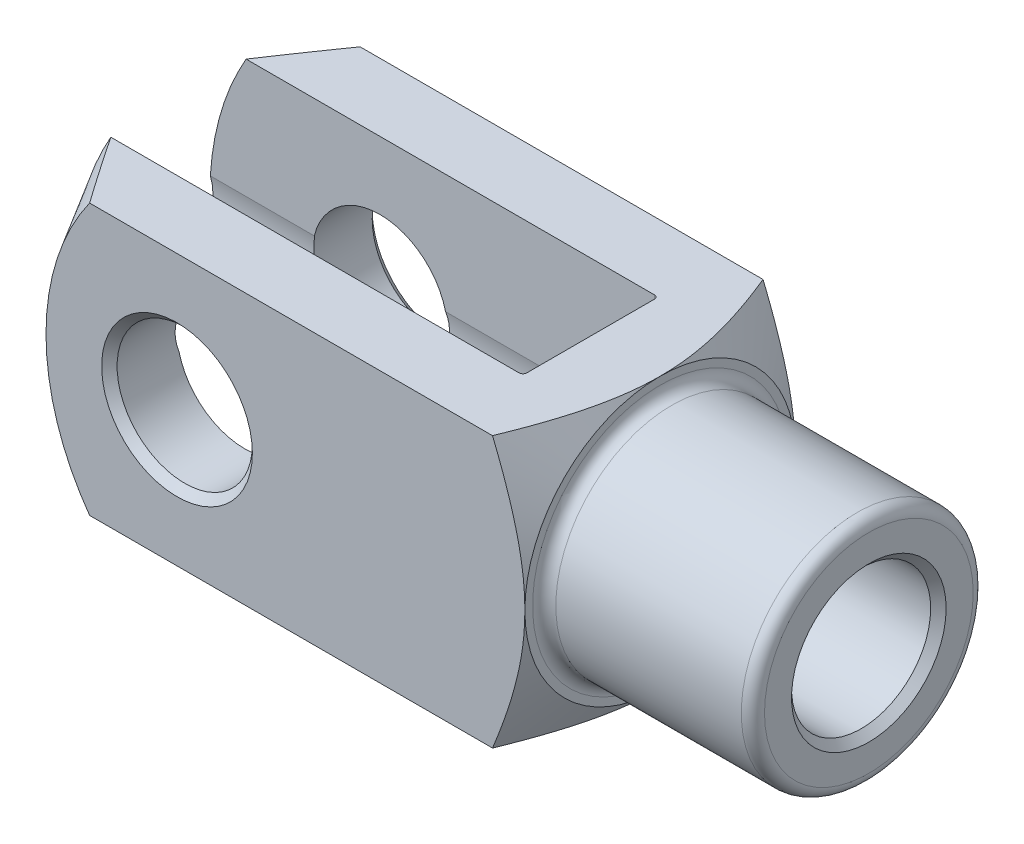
ISO-10303-21;
HEADER;
FILE_DESCRIPTION(('STEP AP214'),'2;1');
FILE_NAME('part.step','',(''),(''),'','','');
FILE_SCHEMA(('AUTOMOTIVE_DESIGN { 1 0 10303 214 1 1 1 1 }'));
ENDSEC;
DATA;
#1=APPLICATION_CONTEXT('core data for automotive mechanical design processes');
#2=APPLICATION_PROTOCOL_DEFINITION('international standard','automotive_design',2000,#1);
#3=PRODUCT_CONTEXT('',#1,'mechanical');
#4=PRODUCT('Part','Part','',(#3));
#5=PRODUCT_RELATED_PRODUCT_CATEGORY('part','',(#4));
#6=PRODUCT_DEFINITION_FORMATION('','',#4);
#7=PRODUCT_DEFINITION_CONTEXT('part definition',#1,'design');
#8=PRODUCT_DEFINITION('design','',#6,#7);
#9=PRODUCT_DEFINITION_SHAPE('','',#8);
#10=(LENGTH_UNIT() NAMED_UNIT(*) SI_UNIT(.MILLI.,.METRE.));
#11=(NAMED_UNIT(*) PLANE_ANGLE_UNIT() SI_UNIT($,.RADIAN.));
#12=(NAMED_UNIT(*) SI_UNIT($,.STERADIAN.) SOLID_ANGLE_UNIT());
#13=UNCERTAINTY_MEASURE_WITH_UNIT(LENGTH_MEASURE(1.E-05),#10,'distance_accuracy_value','');
#14=(GEOMETRIC_REPRESENTATION_CONTEXT(3) GLOBAL_UNCERTAINTY_ASSIGNED_CONTEXT((#13)) GLOBAL_UNIT_ASSIGNED_CONTEXT((#10,
#11,#12)) REPRESENTATION_CONTEXT('',''));
#15=CARTESIAN_POINT('',(0.,0.,0.));
#16=DIRECTION('',(0.,0.,1.));
#17=DIRECTION('',(1.,0.,0.));
#18=AXIS2_PLACEMENT_3D('',#15,#16,#17);
#19=CARTESIAN_POINT('',(-188.,-35.,-17.5));
#20=DIRECTION('',(0.,0.,-1.));
#21=DIRECTION('',(-1.,0.,0.));
#22=AXIS2_PLACEMENT_3D('',#19,#20,#21);
#23=PLANE('',#22);
#24=CARTESIAN_POINT('',(-118.,0.,-17.5));
#25=DIRECTION('',(0.,0.,1.));
#26=DIRECTION('',(1.,0.,0.));
#27=AXIS2_PLACEMENT_3D('',#24,#25,#26);
#28=CIRCLE('',#27,70.);
#29=CARTESIAN_POINT('',(-178.621778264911,35.,-17.5));
#30=VERTEX_POINT('',#29);
#31=CARTESIAN_POINT('',(-187.873099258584,4.21307488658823,-17.5));
#32=VERTEX_POINT('',#31);
#33=EDGE_CURVE('E217',#30,#32,#28,.T.);
#34=ORIENTED_EDGE('',*,*,#33,.T.);
#35=DIRECTION('',(1.,0.,0.));
#36=VECTOR('',#35,1.);
#37=CARTESIAN_POINT('',(-188.,4.21307488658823,-17.5));
#38=LINE('',#37,#36);
#39=CARTESIAN_POINT('',(-160.985287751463,4.21307488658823,-17.5));
#40=VERTEX_POINT('',#39);
#41=EDGE_CURVE('E192',#32,#40,#38,.T.);
#42=ORIENTED_EDGE('',*,*,#41,.T.);
#43=CARTESIAN_POINT('',(-144.,0.,-17.5));
#44=DIRECTION('',(0.,0.,-1.));
#45=DIRECTION('',(-1.,0.,0.));
#46=AXIS2_PLACEMENT_3D('',#43,#44,#45);
#47=CIRCLE('',#46,17.5);
#48=CARTESIAN_POINT('',(-127.014712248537,4.21307488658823,-17.5));
#49=VERTEX_POINT('',#48);
#50=EDGE_CURVE('E623',#49,#40,#47,.F.);
#51=ORIENTED_EDGE('',*,*,#50,.F.);
#52=CARTESIAN_POINT('',(-73.,4.21307488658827,-17.5));
#53=VERTEX_POINT('',#52);
#54=EDGE_CURVE('E324',#49,#53,#38,.T.);
#55=ORIENTED_EDGE('',*,*,#54,.T.);
#56=DIRECTION('',(0.,1.,0.));
#57=VECTOR('',#56,1.);
#58=CARTESIAN_POINT('',(-73.,35.,-17.5));
#59=LINE('',#58,#57);
#60=CARTESIAN_POINT('',(-73.,35.,-17.5));
#61=VERTEX_POINT('',#60);
#62=EDGE_CURVE('E421',#53,#61,#59,.T.);
#63=ORIENTED_EDGE('',*,*,#62,.T.);
#64=DIRECTION('',(-1.,0.,0.));
#65=VECTOR('',#64,1.);
#66=CARTESIAN_POINT('',(-188.,35.,-17.5));
#67=LINE('',#66,#65);
#68=EDGE_CURVE('E654',#61,#30,#67,.T.);
#69=ORIENTED_EDGE('',*,*,#68,.T.);
#70=EDGE_LOOP('',(#34,#42,#51,#55,#63,#69));
#71=FACE_BOUND('',#70,.T.);
#72=ADVANCED_FACE('F37',(#71),#23,.F.);
#73=CARTESIAN_POINT('',(-188.,-35.,17.5));
#74=DIRECTION('',(0.,0.,1.));
#75=DIRECTION('',(1.,0.,0.));
#76=AXIS2_PLACEMENT_3D('',#73,#74,#75);
#77=PLANE('',#76);
#78=CARTESIAN_POINT('',(-118.,0.,17.5));
#79=DIRECTION('',(0.,0.,1.));
#80=DIRECTION('',(1.,0.,0.));
#81=AXIS2_PLACEMENT_3D('',#78,#79,#80);
#82=CIRCLE('',#81,70.);
#83=CARTESIAN_POINT('',(-187.873099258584,-4.21307488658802,17.5));
#84=VERTEX_POINT('',#83);
#85=CARTESIAN_POINT('',(-178.621778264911,-35.,17.5));
#86=VERTEX_POINT('',#85);
#87=EDGE_CURVE('E933',#84,#86,#82,.T.);
#88=ORIENTED_EDGE('',*,*,#87,.F.);
#89=DIRECTION('',(1.,0.,0.));
#90=VECTOR('',#89,1.);
#91=CARTESIAN_POINT('',(-188.,-4.21307488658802,17.5));
#92=LINE('',#91,#90);
#93=CARTESIAN_POINT('',(-160.985287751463,-4.21307488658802,17.5));
#94=VERTEX_POINT('',#93);
#95=EDGE_CURVE('E61',#84,#94,#92,.T.);
#96=ORIENTED_EDGE('',*,*,#95,.T.);
#97=CARTESIAN_POINT('',(-144.,0.,17.5));
#98=DIRECTION('',(0.,0.,1.));
#99=DIRECTION('',(1.,0.,0.));
#100=AXIS2_PLACEMENT_3D('',#97,#98,#99);
#101=CIRCLE('',#100,17.5);
#102=CARTESIAN_POINT('',(-127.014712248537,-4.21307488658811,17.5));
#103=VERTEX_POINT('',#102);
#104=EDGE_CURVE('E620',#103,#94,#101,.F.);
#105=ORIENTED_EDGE('',*,*,#104,.F.);
#106=CARTESIAN_POINT('',(-73.,-4.21307488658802,17.5));
#107=VERTEX_POINT('',#106);
#108=EDGE_CURVE('E287',#103,#107,#92,.T.);
#109=ORIENTED_EDGE('',*,*,#108,.T.);
#110=DIRECTION('',(0.,1.,0.));
#111=VECTOR('',#110,1.);
#112=CARTESIAN_POINT('',(-73.,-35.,17.5));
#113=LINE('',#112,#111);
#114=CARTESIAN_POINT('',(-73.,-35.,17.5));
#115=VERTEX_POINT('',#114);
#116=EDGE_CURVE('E407',#107,#115,#113,.F.);
#117=ORIENTED_EDGE('',*,*,#116,.T.);
#118=DIRECTION('',(1.,0.,0.));
#119=VECTOR('',#118,1.);
#120=CARTESIAN_POINT('',(-188.,-35.,17.5));
#121=LINE('',#120,#119);
#122=EDGE_CURVE('E645',#86,#115,#121,.T.);
#123=ORIENTED_EDGE('',*,*,#122,.F.);
#124=EDGE_LOOP('',(#88,#96,#105,#109,#117,#123));
#125=FACE_BOUND('',#124,.T.);
#126=ADVANCED_FACE('F384',(#125),#77,.F.);
#127=CARTESIAN_POINT('',(-73.,-35.,-16.5));
#128=DIRECTION('',(0.,-1.,0.));
#129=DIRECTION('',(0.,0.,-1.));
#130=AXIS2_PLACEMENT_3D('',#127,#128,#129);
#131=CYLINDRICAL_SURFACE('',#130,1.);
#132=DIRECTION('',(0.,1.,0.));
#133=VECTOR('',#132,1.);
#134=CARTESIAN_POINT('',(-72.,-35.,-16.5));
#135=LINE('',#134,#133);
#136=CARTESIAN_POINT('',(-72.,-7.19374728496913,-16.5));
#137=VERTEX_POINT('',#136);
#138=CARTESIAN_POINT('',(-72.,-35.,-16.5));
#139=VERTEX_POINT('',#138);
#140=EDGE_CURVE('E612',#137,#139,#135,.F.);
#141=ORIENTED_EDGE('',*,*,#140,.F.);
#142=CARTESIAN_POINT('',(-72.,-7.19374728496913,-16.5));
#143=CARTESIAN_POINT('',(-72.0000131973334,-7.11650112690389,-16.5336792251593));
#144=CARTESIAN_POINT('',(-72.0017010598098,-7.03902736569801,-16.5668099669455));
#145=CARTESIAN_POINT('',(-72.0081979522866,-6.88374477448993,-16.631931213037));
#146=CARTESIAN_POINT('',(-72.0130065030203,-6.80593599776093,-16.6639218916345));
#147=CARTESIAN_POINT('',(-72.0255252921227,-6.64997334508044,-16.7267729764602));
#148=CARTESIAN_POINT('',(-72.0332394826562,-6.57181914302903,-16.7576317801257));
#149=CARTESIAN_POINT('',(-72.0514330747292,-6.41537083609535,-16.8181466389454));
#150=CARTESIAN_POINT('',(-72.0619125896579,-6.33707672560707,-16.8478026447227));
#151=CARTESIAN_POINT('',(-72.0975002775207,-6.10110867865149,-16.9353095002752));
#152=CARTESIAN_POINT('',(-72.1266769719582,-5.94332461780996,-16.9913062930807));
#153=CARTESIAN_POINT('',(-72.1787390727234,-5.70728135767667,-17.0714338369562));
#154=CARTESIAN_POINT('',(-72.1974693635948,-5.62872826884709,-17.0974914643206));
#155=CARTESIAN_POINT('',(-72.2379230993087,-5.47197340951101,-17.1483027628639));
#156=CARTESIAN_POINT('',(-72.2596461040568,-5.39377158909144,-17.17305662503));
#157=CARTESIAN_POINT('',(-72.3036354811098,-5.24742606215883,-17.2182941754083));
#158=CARTESIAN_POINT('',(-72.3255157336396,-5.17921383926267,-17.2389314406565));
#159=CARTESIAN_POINT('',(-72.3723270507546,-5.04361615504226,-17.2790891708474));
#160=CARTESIAN_POINT('',(-72.3972535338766,-4.97622961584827,-17.2986112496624));
#161=CARTESIAN_POINT('',(-72.4429187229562,-4.86277710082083,-17.3307748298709));
#162=CARTESIAN_POINT('',(-72.462660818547,-4.81639672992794,-17.3437192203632));
#163=CARTESIAN_POINT('',(-72.5045668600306,-4.72444426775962,-17.3689924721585));
#164=CARTESIAN_POINT('',(-72.5267351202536,-4.67887378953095,-17.3813201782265));
#165=CARTESIAN_POINT('',(-72.5750180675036,-4.58766965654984,-17.4056195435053));
#166=CARTESIAN_POINT('',(-72.6012408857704,-4.5420860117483,-17.4175650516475));
#167=CARTESIAN_POINT('',(-72.6584179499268,-4.45374001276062,-17.4403625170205));
#168=CARTESIAN_POINT('',(-72.6893539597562,-4.41096765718,-17.4512184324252));
#169=CARTESIAN_POINT('',(-72.7382377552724,-4.35495179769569,-17.4652421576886));
#170=CARTESIAN_POINT('',(-72.7530557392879,-4.33919674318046,-17.4691617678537));
#171=CARTESIAN_POINT('',(-72.7843175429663,-4.30915314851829,-17.4765968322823));
#172=CARTESIAN_POINT('',(-72.8007657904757,-4.29486882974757,-17.4801111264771));
#173=CARTESIAN_POINT('',(-72.8358695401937,-4.26835902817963,-17.4866034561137));
#174=CARTESIAN_POINT('',(-72.8545594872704,-4.25617530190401,-17.4895706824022));
#175=CARTESIAN_POINT('',(-72.8939752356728,-4.23563034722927,-17.4945576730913));
#176=CARTESIAN_POINT('',(-72.9146820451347,-4.22723699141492,-17.4965854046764));
#177=CARTESIAN_POINT('',(-72.9464885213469,-4.21879874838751,-17.4986212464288));
#178=CARTESIAN_POINT('',(-72.9570132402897,-4.21668135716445,-17.4991314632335));
#179=CARTESIAN_POINT('',(-72.9783511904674,-4.21380665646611,-17.4998238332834));
#180=CARTESIAN_POINT('',(-72.9891661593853,-4.21306166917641,-17.5000030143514));
#181=CARTESIAN_POINT('',(-72.9999999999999,-4.21307488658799,-17.5000000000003));
#182=B_SPLINE_CURVE_WITH_KNOTS('',3,(#142,#143,#144,#145,#146,#147,#148,#149,#150,#151,#152,
#153,#154,#155,#156,#157,#158,#159,#160,#161,#162,#163,#164,#165,#166,#167,#168,#169,#170,#171,
#172,#173,#174,#175,#176,#177,#178,#179,#180,#181),.UNSPECIFIED.,.F.,.F.,(4,2,2,2,2,2,2,2,2,2,2,
2,2,2,2,2,2,2,2,4),(0.,0.252772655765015,0.505506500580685,0.758585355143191,1.01167458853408,
1.52101108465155,1.77553281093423,2.0300171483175,2.25360699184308,2.47686460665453,
2.63294713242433,2.78931186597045,2.95096606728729,3.112009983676,3.17787365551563,
3.24392139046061,3.31115976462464,3.37781700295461,3.40997218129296,3.44241468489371),.UNSPECIFIED.);
#183=CARTESIAN_POINT('',(-73.,-4.21307488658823,-17.5));
#184=VERTEX_POINT('',#183);
#185=EDGE_CURVE('E344',#137,#184,#182,.T.);
#186=ORIENTED_EDGE('',*,*,#185,.T.);
#187=CARTESIAN_POINT('',(-73.,-35.,-17.5));
#188=VERTEX_POINT('',#187);
#189=EDGE_CURVE('E427',#188,#184,#59,.T.);
#190=ORIENTED_EDGE('',*,*,#189,.F.);
#191=CARTESIAN_POINT('',(-73.,-35.,-16.5));
#192=DIRECTION('',(0.,-1.,0.));
#193=DIRECTION('',(0.,0.,-1.));
#194=AXIS2_PLACEMENT_3D('',#191,#192,#193);
#195=CIRCLE('',#194,1.);
#196=EDGE_CURVE('E438',#139,#188,#195,.F.);
#197=ORIENTED_EDGE('',*,*,#196,.F.);
#198=EDGE_LOOP('',(#141,#186,#190,#197));
#199=FACE_BOUND('',#198,.T.);
#200=ADVANCED_FACE('F363',(#199),#131,.F.);
#201=CARTESIAN_POINT('',(-72.,-35.,-17.5));
#202=DIRECTION('',(1.,0.,0.));
#203=DIRECTION('',(0.,0.,-1.));
#204=AXIS2_PLACEMENT_3D('',#201,#202,#203);
#205=PLANE('',#204);
#206=CARTESIAN_POINT('',(-72.,35.,-16.5));
#207=VERTEX_POINT('',#206);
#208=CARTESIAN_POINT('',(-72.,7.19374728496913,-16.5));
#209=VERTEX_POINT('',#208);
#210=EDGE_CURVE('E626',#207,#209,#135,.F.);
#211=ORIENTED_EDGE('',*,*,#210,.T.);
#212=CARTESIAN_POINT('',(-72.,0.,0.));
#213=DIRECTION('',(1.,0.,0.));
#214=DIRECTION('',(0.,0.,-1.));
#215=AXIS2_PLACEMENT_3D('',#212,#213,#214);
#216=CIRCLE('',#215,18.);
#217=CARTESIAN_POINT('',(-72.,7.19374728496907,16.5));
#218=VERTEX_POINT('',#217);
#219=EDGE_CURVE('E927',#209,#218,#216,.T.);
#220=ORIENTED_EDGE('',*,*,#219,.T.);
#221=DIRECTION('',(0.,1.,0.));
#222=VECTOR('',#221,1.);
#223=CARTESIAN_POINT('',(-72.,35.,16.5));
#224=LINE('',#223,#222);
#225=CARTESIAN_POINT('',(-72.,35.,16.5));
#226=VERTEX_POINT('',#225);
#227=EDGE_CURVE('E423',#218,#226,#224,.T.);
#228=ORIENTED_EDGE('',*,*,#227,.T.);
#229=DIRECTION('',(0.,0.,-1.));
#230=VECTOR('',#229,1.);
#231=CARTESIAN_POINT('',(-72.,35.,-17.5));
#232=LINE('',#231,#230);
#233=EDGE_CURVE('E649',#226,#207,#232,.T.);
#234=ORIENTED_EDGE('',*,*,#233,.T.);
#235=EDGE_LOOP('',(#211,#220,#228,#234));
#236=FACE_BOUND('',#235,.T.);
#237=ADVANCED_FACE('F398',(#236),#205,.F.);
#238=CARTESIAN_POINT('',(-73.,-35.,16.5));
#239=DIRECTION('',(0.,-1.,0.));
#240=DIRECTION('',(0.,0.,-1.));
#241=AXIS2_PLACEMENT_3D('',#238,#239,#240);
#242=CYLINDRICAL_SURFACE('',#241,1.);
#243=ORIENTED_EDGE('',*,*,#116,.F.);
#244=CARTESIAN_POINT('',(-73.,-4.21307488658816,17.5));
#245=CARTESIAN_POINT('',(-72.9829605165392,-4.21300539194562,17.5000159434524));
#246=CARTESIAN_POINT('',(-72.966041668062,-4.21488071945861,17.4995653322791));
#247=CARTESIAN_POINT('',(-72.9332135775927,-4.22180791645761,17.4978957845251));
#248=CARTESIAN_POINT('',(-72.9172915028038,-4.22680083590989,17.4966911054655));
#249=CARTESIAN_POINT('',(-72.8827128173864,-4.24086270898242,17.4932885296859));
#250=CARTESIAN_POINT('',(-72.8643720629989,-4.25063992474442,17.4909172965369));
#251=CARTESIAN_POINT('',(-72.8293871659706,-4.27287975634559,17.485497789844));
#252=CARTESIAN_POINT('',(-72.8127570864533,-4.28536235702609,17.4824444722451));
#253=CARTESIAN_POINT('',(-72.7666754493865,-4.3241946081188,17.4728937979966));
#254=CARTESIAN_POINT('',(-72.7393159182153,-4.35283241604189,17.4657893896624));
#255=CARTESIAN_POINT('',(-72.6886163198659,-4.41314085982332,17.4506496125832));
#256=CARTESIAN_POINT('',(-72.6652849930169,-4.44481786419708,17.4426122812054));
#257=CARTESIAN_POINT('',(-72.624182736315,-4.50591953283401,17.4269205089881));
#258=CARTESIAN_POINT('',(-72.6060808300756,-4.53514285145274,17.4193403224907));
#259=CARTESIAN_POINT('',(-72.5715900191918,-4.59448781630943,17.4037819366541));
#260=CARTESIAN_POINT('',(-72.5552020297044,-4.62460993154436,17.3958035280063));
#261=CARTESIAN_POINT('',(-72.5080240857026,-4.71600474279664,17.3713347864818));
#262=CARTESIAN_POINT('',(-72.4792876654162,-4.77819895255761,17.3543383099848));
#263=CARTESIAN_POINT('',(-72.4254389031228,-4.90441873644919,17.31909410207));
#264=CARTESIAN_POINT('',(-72.4003599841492,-4.96845548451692,17.300836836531));
#265=CARTESIAN_POINT('',(-72.3532834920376,-5.09727188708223,17.2633228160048));
#266=CARTESIAN_POINT('',(-72.3312826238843,-5.16205066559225,17.2440671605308));
#267=CARTESIAN_POINT('',(-72.2840320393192,-5.31025061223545,17.1990927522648));
#268=CARTESIAN_POINT('',(-72.2595865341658,-5.39383430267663,17.1730687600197));
#269=CARTESIAN_POINT('',(-72.2142284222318,-5.56148672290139,17.1195097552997));
#270=CARTESIAN_POINT('',(-72.1933165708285,-5.64555555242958,17.0919744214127));
#271=CARTESIAN_POINT('',(-72.1547052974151,-5.8140457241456,17.0353978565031));
#272=CARTESIAN_POINT('',(-72.1370099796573,-5.89846737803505,17.0063547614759));
#273=CARTESIAN_POINT('',(-72.1047361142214,-6.06739595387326,16.9468205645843));
#274=CARTESIAN_POINT('',(-72.0901575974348,-6.1519028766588,16.9163294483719));
#275=CARTESIAN_POINT('',(-72.06476976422,-6.31661868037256,16.8554929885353));
#276=CARTESIAN_POINT('',(-72.0538076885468,-6.39682984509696,16.8252175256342));
#277=CARTESIAN_POINT('',(-72.034773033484,-6.55710563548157,16.7634048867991));
#278=CARTESIAN_POINT('',(-72.0267003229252,-6.63717026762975,16.7318677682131));
#279=CARTESIAN_POINT('',(-72.013606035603,-6.79686678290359,16.6676329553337));
#280=CARTESIAN_POINT('',(-72.0085773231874,-6.87649924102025,16.634938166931));
#281=CARTESIAN_POINT('',(-72.0017814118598,-7.03541654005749,16.5683538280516));
#282=CARTESIAN_POINT('',(-72.0000147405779,-7.11470132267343,16.5344640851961));
#283=CARTESIAN_POINT('',(-72.,-7.19374728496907,16.5));
#284=B_SPLINE_CURVE_WITH_KNOTS('',3,(#244,#245,#246,#247,#248,#249,#250,#251,#252,#253,#254,
#255,#256,#257,#258,#259,#260,#261,#262,#263,#264,#265,#266,#267,#268,#269,#270,#271,#272,#273,
#274,#275,#276,#277,#278,#279,#280,#281,#282,#283),.UNSPECIFIED.,.F.,.F.,(4,2,2,2,2,2,2,2,2,2,2,
2,2,2,2,2,2,2,2,4),(0.,0.050817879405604,0.100702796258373,0.16310045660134,0.225975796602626,
0.346025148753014,0.466331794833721,0.571859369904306,0.677443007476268,0.888996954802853,
1.10237697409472,1.31552679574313,1.58809983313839,1.8607310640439,2.13370776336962,
2.40668716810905,2.66592937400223,2.92515980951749,3.1837801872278,3.44244239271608),.UNSPECIFIED.);
#285=CARTESIAN_POINT('',(-72.,-7.19374728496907,16.5));
#286=VERTEX_POINT('',#285);
#287=EDGE_CURVE('E336',#107,#286,#284,.T.);
#288=ORIENTED_EDGE('',*,*,#287,.T.);
#289=CARTESIAN_POINT('',(-72.,-35.,16.5));
#290=VERTEX_POINT('',#289);
#291=EDGE_CURVE('E416',#290,#286,#224,.T.);
#292=ORIENTED_EDGE('',*,*,#291,.F.);
#293=CARTESIAN_POINT('',(-73.,-35.,16.5));
#294=DIRECTION('',(0.,-1.,0.));
#295=DIRECTION('',(0.,0.,-1.));
#296=AXIS2_PLACEMENT_3D('',#293,#294,#295);
#297=CIRCLE('',#296,1.);
#298=EDGE_CURVE('E410',#115,#290,#297,.F.);
#299=ORIENTED_EDGE('',*,*,#298,.F.);
#300=EDGE_LOOP('',(#243,#288,#292,#299));
#301=FACE_BOUND('',#300,.T.);
#302=ADVANCED_FACE('F354',(#301),#242,.F.);
#303=ORIENTED_EDGE('',*,*,#189,.T.);
#304=DIRECTION('',(1.,0.,0.));
#305=VECTOR('',#304,1.);
#306=CARTESIAN_POINT('',(-188.,-4.21307488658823,-17.5));
#307=LINE('',#306,#305);
#308=CARTESIAN_POINT('',(-127.014712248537,-4.21307488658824,-17.5));
#309=VERTEX_POINT('',#308);
#310=EDGE_CURVE('E211',#184,#309,#307,.F.);
#311=ORIENTED_EDGE('',*,*,#310,.T.);
#312=CARTESIAN_POINT('',(-160.985287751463,-4.21307488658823,-17.5));
#313=VERTEX_POINT('',#312);
#314=EDGE_CURVE('E208',#313,#309,#47,.F.);
#315=ORIENTED_EDGE('',*,*,#314,.F.);
#316=CARTESIAN_POINT('',(-187.873099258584,-4.21307488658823,-17.5));
#317=VERTEX_POINT('',#316);
#318=EDGE_CURVE('E189',#313,#317,#307,.F.);
#319=ORIENTED_EDGE('',*,*,#318,.T.);
#320=CARTESIAN_POINT('',(-178.621778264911,-35.,-17.5));
#321=VERTEX_POINT('',#320);
#322=EDGE_CURVE('E204',#317,#321,#28,.T.);
#323=ORIENTED_EDGE('',*,*,#322,.T.);
#324=DIRECTION('',(-1.,0.,0.));
#325=VECTOR('',#324,1.);
#326=CARTESIAN_POINT('',(-188.,-35.,-17.5));
#327=LINE('',#326,#325);
#328=EDGE_CURVE('E552',#188,#321,#327,.T.);
#329=ORIENTED_EDGE('',*,*,#328,.F.);
#330=EDGE_LOOP('',(#303,#311,#315,#319,#323,#329));
#331=FACE_BOUND('',#330,.T.);
#332=ADVANCED_FACE('F202',(#331),#23,.F.);
#333=CARTESIAN_POINT('',(-73.,35.,17.5));
#334=VERTEX_POINT('',#333);
#335=CARTESIAN_POINT('',(-73.,4.21307488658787,17.5));
#336=VERTEX_POINT('',#335);
#337=EDGE_CURVE('E415',#334,#336,#113,.F.);
#338=ORIENTED_EDGE('',*,*,#337,.T.);
#339=DIRECTION('',(1.,0.,0.));
#340=VECTOR('',#339,1.);
#341=CARTESIAN_POINT('',(-188.,4.21307488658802,17.5));
#342=LINE('',#341,#340);
#343=CARTESIAN_POINT('',(-127.014712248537,4.21307488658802,17.5));
#344=VERTEX_POINT('',#343);
#345=EDGE_CURVE('E53',#336,#344,#342,.F.);
#346=ORIENTED_EDGE('',*,*,#345,.T.);
#347=CARTESIAN_POINT('',(-160.985287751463,4.21307488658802,17.5));
#348=VERTEX_POINT('',#347);
#349=EDGE_CURVE('E624',#348,#344,#101,.F.);
#350=ORIENTED_EDGE('',*,*,#349,.F.);
#351=CARTESIAN_POINT('',(-187.873099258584,4.21307488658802,17.5));
#352=VERTEX_POINT('',#351);
#353=EDGE_CURVE('E274',#348,#352,#342,.F.);
#354=ORIENTED_EDGE('',*,*,#353,.T.);
#355=CARTESIAN_POINT('',(-178.621778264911,35.,17.5));
#356=VERTEX_POINT('',#355);
#357=EDGE_CURVE('E935',#356,#352,#82,.T.);
#358=ORIENTED_EDGE('',*,*,#357,.F.);
#359=DIRECTION('',(1.,0.,0.));
#360=VECTOR('',#359,1.);
#361=CARTESIAN_POINT('',(-188.,35.,17.5));
#362=LINE('',#361,#360);
#363=EDGE_CURVE('E652',#356,#334,#362,.T.);
#364=ORIENTED_EDGE('',*,*,#363,.T.);
#365=EDGE_LOOP('',(#338,#346,#350,#354,#358,#364));
#366=FACE_BOUND('',#365,.T.);
#367=ADVANCED_FACE('F390',(#366),#77,.F.);
#368=CARTESIAN_POINT('',(-188.,-35.,35.));
#369=DIRECTION('',(0.,0.,1.));
#370=DIRECTION('',(1.,0.,0.));
#371=AXIS2_PLACEMENT_3D('',#368,#369,#370);
#372=PLANE('',#371);
#373=CARTESIAN_POINT('',(-144.,0.,35.));
#374=DIRECTION('',(0.,0.,1.));
#375=DIRECTION('',(1.,0.,0.));
#376=AXIS2_PLACEMENT_3D('',#373,#374,#375);
#377=CIRCLE('',#376,19.5);
#378=CARTESIAN_POINT('',(-124.5,0.,35.));
#379=VERTEX_POINT('',#378);
#380=EDGE_CURVE('E469',#379,#379,#377,.F.);
#381=ORIENTED_EDGE('',*,*,#380,.T.);
#382=EDGE_LOOP('',(#381));
#383=FACE_BOUND('',#382,.T.);
#384=DIRECTION('',(1.,0.,0.));
#385=VECTOR('',#384,1.);
#386=CARTESIAN_POINT('',(-188.,35.,35.));
#387=LINE('',#386,#385);
#388=CARTESIAN_POINT('',(-166.606328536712,35.,35.));
#389=VERTEX_POINT('',#388);
#390=CARTESIAN_POINT('',(-62.3701209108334,35.,35.));
#391=VERTEX_POINT('',#390);
#392=EDGE_CURVE('E592',#389,#391,#387,.T.);
#393=ORIENTED_EDGE('',*,*,#392,.F.);
#394=CARTESIAN_POINT('',(-118.,0.,35.));
#395=DIRECTION('',(0.,0.,1.));
#396=DIRECTION('',(1.,0.,0.));
#397=AXIS2_PLACEMENT_3D('',#394,#395,#396);
#398=CIRCLE('',#397,59.8963702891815);
#399=CARTESIAN_POINT('',(-166.606328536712,-35.,35.));
#400=VERTEX_POINT('',#399);
#401=EDGE_CURVE('E225',#389,#400,#398,.T.);
#402=ORIENTED_EDGE('',*,*,#401,.T.);
#403=DIRECTION('',(1.,0.,0.));
#404=VECTOR('',#403,1.);
#405=CARTESIAN_POINT('',(-188.,-35.,35.));
#406=LINE('',#405,#404);
#407=CARTESIAN_POINT('',(-62.3701209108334,-35.,35.));
#408=VERTEX_POINT('',#407);
#409=EDGE_CURVE('E599',#400,#408,#406,.T.);
#410=ORIENTED_EDGE('',*,*,#409,.T.);
#411=CARTESIAN_POINT('',(-79.7455571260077,-71.4841524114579,35.));
#412=CARTESIAN_POINT('',(-79.2983354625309,-70.6216687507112,35.));
#413=CARTESIAN_POINT('',(-78.8523395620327,-69.7585498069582,35.));
#414=CARTESIAN_POINT('',(-77.9630613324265,-68.0309117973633,35.));
#415=CARTESIAN_POINT('',(-77.5197790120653,-67.1663927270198,35.));
#416=CARTESIAN_POINT('',(-76.1943552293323,-64.5704620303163,35.));
#417=CARTESIAN_POINT('',(-75.3166821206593,-62.8367639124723,35.));
#418=CARTESIAN_POINT('',(-73.5744168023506,-59.3590234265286,35.));
#419=CARTESIAN_POINT('',(-72.7098500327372,-57.6149683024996,35.));
#420=CARTESIAN_POINT('',(-70.9988898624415,-54.1179792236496,35.));
#421=CARTESIAN_POINT('',(-70.1524961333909,-52.3650454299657,35.));
#422=CARTESIAN_POINT('',(-68.8743862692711,-49.673396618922,35.));
#423=CARTESIAN_POINT('',(-68.4344483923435,-48.7385836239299,35.));
#424=CARTESIAN_POINT('',(-67.5619188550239,-46.865537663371,35.));
#425=CARTESIAN_POINT('',(-67.1293271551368,-45.9273047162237,35.));
#426=CARTESIAN_POINT('',(-66.2724882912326,-44.0469670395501,35.));
#427=CARTESIAN_POINT('',(-65.8482416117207,-43.1048620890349,35.));
#428=CARTESIAN_POINT('',(-65.0093315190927,-41.2163859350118,35.));
#429=CARTESIAN_POINT('',(-64.594668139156,-40.2700147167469,35.));
#430=CARTESIAN_POINT('',(-63.7765361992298,-38.3729279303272,35.));
#431=CARTESIAN_POINT('',(-63.3730628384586,-37.4222144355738,35.));
#432=CARTESIAN_POINT('',(-62.5788187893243,-35.5154994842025,35.));
#433=CARTESIAN_POINT('',(-62.1880479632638,-34.5594980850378,35.));
#434=CARTESIAN_POINT('',(-61.4212481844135,-32.6417187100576,35.));
#435=CARTESIAN_POINT('',(-61.0452174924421,-31.6799414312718,35.));
#436=CARTESIAN_POINT('',(-60.3101986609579,-29.7498374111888,35.));
#437=CARTESIAN_POINT('',(-59.9512112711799,-28.781510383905,35.));
#438=CARTESIAN_POINT('',(-59.1773660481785,-26.6269700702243,35.));
#439=CARTESIAN_POINT('',(-58.7672704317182,-25.4390360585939,35.));
#440=CARTESIAN_POINT('',(-57.9823694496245,-23.0516177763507,35.));
#441=CARTESIAN_POINT('',(-57.6075610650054,-21.8521345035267,35.));
#442=CARTESIAN_POINT('',(-56.9001918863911,-19.4407071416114,35.));
#443=CARTESIAN_POINT('',(-56.5676302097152,-18.2287633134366,35.));
#444=CARTESIAN_POINT('',(-55.9526962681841,-15.79212691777,35.));
#445=CARTESIAN_POINT('',(-55.6703234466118,-14.5674344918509,35.));
#446=CARTESIAN_POINT('',(-55.1702230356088,-12.1346782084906,35.));
#447=CARTESIAN_POINT('',(-54.9511335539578,-10.926898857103,35.));
#448=CARTESIAN_POINT('',(-54.6702587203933,-9.10791584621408,35.));
#449=CARTESIAN_POINT('',(-54.5845910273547,-8.50034299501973,35.));
#450=CARTESIAN_POINT('',(-54.4300119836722,-7.28307909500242,35.));
#451=CARTESIAN_POINT('',(-54.3610998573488,-6.67338814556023,35.));
#452=CARTESIAN_POINT('',(-54.2408047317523,-5.45265711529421,35.));
#453=CARTESIAN_POINT('',(-54.1894109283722,-4.84161810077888,35.));
#454=CARTESIAN_POINT('',(-54.1046686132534,-3.61828422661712,35.));
#455=CARTESIAN_POINT('',(-54.0713201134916,-3.00598936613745,35.));
#456=CARTESIAN_POINT('',(-54.0230583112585,-1.78068731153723,35.));
#457=CARTESIAN_POINT('',(-54.0081445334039,-1.16768013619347,35.));
#458=CARTESIAN_POINT('',(-53.9969287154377,0.0585026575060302,35.));
#459=CARTESIAN_POINT('',(-54.0006265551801,0.67167827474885,35.));
#460=CARTESIAN_POINT('',(-54.0256414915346,1.85294442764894,35.));
#461=CARTESIAN_POINT('',(-54.0456545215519,2.42106307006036,35.));
#462=CARTESIAN_POINT('',(-54.1014333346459,3.55654632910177,35.));
#463=CARTESIAN_POINT('',(-54.1371997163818,4.12391091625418,35.));
#464=CARTESIAN_POINT('',(-54.2241302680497,5.25742922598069,35.));
#465=CARTESIAN_POINT('',(-54.2752936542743,5.82358300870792,35.));
#466=CARTESIAN_POINT('',(-54.3925261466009,6.95435287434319,35.));
#467=CARTESIAN_POINT('',(-54.4585958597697,7.51896889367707,35.));
#468=CARTESIAN_POINT('',(-54.6783609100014,9.21054236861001,35.));
#469=CARTESIAN_POINT('',(-54.8535756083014,10.3347599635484,35.));
#470=CARTESIAN_POINT('',(-55.2556333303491,12.5738033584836,35.));
#471=CARTESIAN_POINT('',(-55.4824777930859,13.6886288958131,35.));
#472=CARTESIAN_POINT('',(-55.9887006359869,15.94014365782,35.));
#473=CARTESIAN_POINT('',(-56.2694095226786,17.0765317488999,35.));
#474=CARTESIAN_POINT('',(-56.8720367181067,19.3382710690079,35.));
#475=CARTESIAN_POINT('',(-57.1939554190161,20.4636221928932,35.));
#476=CARTESIAN_POINT('',(-57.703069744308,22.1435871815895,35.));
#477=CARTESIAN_POINT('',(-57.8771454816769,22.7022267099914,35.));
#478=CARTESIAN_POINT('',(-58.2333547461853,23.8169352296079,35.));
#479=CARTESIAN_POINT('',(-58.4154882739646,24.3730042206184,35.));
#480=CARTESIAN_POINT('',(-58.7871408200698,25.4826284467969,35.));
#481=CARTESIAN_POINT('',(-58.9766594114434,26.0361838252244,35.));
#482=CARTESIAN_POINT('',(-59.362488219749,27.1409163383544,35.));
#483=CARTESIAN_POINT('',(-59.5587984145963,27.6920934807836,35.));
#484=CARTESIAN_POINT('',(-60.1895678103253,29.4318816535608,35.));
#485=CARTESIAN_POINT('',(-60.6354807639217,30.6163513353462,35.));
#486=CARTESIAN_POINT('',(-61.5515172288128,32.9759195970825,35.));
#487=CARTESIAN_POINT('',(-62.0216421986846,34.1510176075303,35.));
#488=CARTESIAN_POINT('',(-62.982193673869,36.4931780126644,35.));
#489=CARTESIAN_POINT('',(-63.4726247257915,37.6602385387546,35.));
#490=CARTESIAN_POINT('',(-64.4704100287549,39.9870590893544,35.));
#491=CARTESIAN_POINT('',(-64.9777639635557,41.1468192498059,35.));
#492=CARTESIAN_POINT('',(-66.0071895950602,43.4609776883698,35.));
#493=CARTESIAN_POINT('',(-66.5292736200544,44.6153704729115,35.));
#494=CARTESIAN_POINT('',(-67.5855656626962,46.9185930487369,35.));
#495=CARTESIAN_POINT('',(-68.1197737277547,48.0674228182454,35.));
#496=CARTESIAN_POINT('',(-69.1984683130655,50.36008259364,35.));
#497=CARTESIAN_POINT('',(-69.74295366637,51.5039131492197,35.));
#498=CARTESIAN_POINT('',(-70.8407931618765,53.7873038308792,35.));
#499=CARTESIAN_POINT('',(-71.3941472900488,54.9268639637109,35.));
#500=CARTESIAN_POINT('',(-72.5102077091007,57.2056982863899,35.));
#501=CARTESIAN_POINT('',(-73.0729373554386,58.3449610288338,35.));
#502=CARTESIAN_POINT('',(-74.2050779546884,60.620159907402,35.));
#503=CARTESIAN_POINT('',(-74.774488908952,61.7560960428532,35.));
#504=CARTESIAN_POINT('',(-75.919147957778,64.0250497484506,35.));
#505=CARTESIAN_POINT('',(-76.4943961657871,65.1580672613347,35.));
#506=CARTESIAN_POINT('',(-77.6500048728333,67.4214931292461,35.));
#507=CARTESIAN_POINT('',(-78.2303653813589,68.5519014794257,35.));
#508=CARTESIAN_POINT('',(-79.9775989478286,71.9385331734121,35.));
#509=CARTESIAN_POINT('',(-81.151193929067,74.1912896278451,35.));
#510=CARTESIAN_POINT('',(-83.512438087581,78.6893897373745,35.));
#511=CARTESIAN_POINT('',(-84.7000871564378,80.934733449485,35.));
#512=CARTESIAN_POINT('',(-86.9094378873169,85.0864160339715,35.));
#513=CARTESIAN_POINT('',(-87.9295909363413,86.9935796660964,35.));
#514=CARTESIAN_POINT('',(-89.9767304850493,90.8042363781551,35.));
#515=CARTESIAN_POINT('',(-91.0037169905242,92.7077294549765,35.));
#516=CARTESIAN_POINT('',(-93.0635983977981,96.5118602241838,35.));
#517=CARTESIAN_POINT('',(-94.0964941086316,98.4124974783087,35.));
#518=CARTESIAN_POINT('',(-96.1671930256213,102.211097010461,35.));
#519=CARTESIAN_POINT('',(-97.2049962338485,104.109059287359,35.));
#520=CARTESIAN_POINT('',(-99.2788542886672,107.891810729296,35.));
#521=CARTESIAN_POINT('',(-100.314885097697,109.776613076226,35.));
#522=CARTESIAN_POINT('',(-102.390544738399,113.544235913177,35.));
#523=CARTESIAN_POINT('',(-103.430173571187,115.427056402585,35.));
#524=CARTESIAN_POINT('',(-105.51239361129,119.190669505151,35.));
#525=CARTESIAN_POINT('',(-106.55498432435,121.071462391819,35.));
#526=CARTESIAN_POINT('',(-108.642913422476,124.831519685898,35.));
#527=CARTESIAN_POINT('',(-109.68825180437,126.710784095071,35.));
#528=CARTESIAN_POINT('',(-110.734776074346,128.589387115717,35.));
#529=B_SPLINE_CURVE_WITH_KNOTS('',3,(#411,#412,#413,#414,#415,#416,#417,#418,#419,#420,#421,
#422,#423,#424,#425,#426,#427,#428,#429,#430,#431,#432,#433,#434,#435,#436,#437,#438,#439,#440,
#441,#442,#443,#444,#445,#446,#447,#448,#449,#450,#451,#452,#453,#454,#455,#456,#457,#458,#459,
#460,#461,#462,#463,#464,#465,#466,#467,#468,#469,#470,#471,#472,#473,#474,#475,#476,#477,#478,
#479,#480,#481,#482,#483,#484,#485,#486,#487,#488,#489,#490,#491,#492,#493,#494,#495,#496,#497,
#498,#499,#500,#501,#502,#503,#504,#505,#506,#507,#508,#509,#510,#511,#512,#513,#514,#515,#516,
#517,#518,#519,#520,#521,#522,#523,#524,#525,#526,#527,#528),.UNSPECIFIED.,.F.,.F.,(4,2,2,2,2,2,
2,2,2,2,2,2,2,2,2,2,2,2,2,2,2,2,2,2,2,2,2,2,2,2,2,2,2,2,2,2,2,2,2,2,2,2,2,2,2,2,2,2,2,2,2,2,2,2,
2,2,2,2,4),(0.,2.91461071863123,5.82923082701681,11.6587651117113,17.4984507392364,
23.3380307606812,26.437486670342,29.5369259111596,32.6365445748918,35.7361739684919,
38.8344523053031,41.9326970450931,45.0305751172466,48.128589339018,51.8983063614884,
55.6677005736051,59.4370160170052,63.206289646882,66.8870829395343,68.7276372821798,
70.5681064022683,72.4074383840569,74.2467715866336,76.0860573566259,77.9253312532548,
79.6305250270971,81.3357836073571,83.0409554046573,84.7461966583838,88.1580776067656,
91.5700536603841,95.0807863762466,98.5915525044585,100.346902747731,102.102253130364,
103.857502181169,105.6127455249,109.409260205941,113.206003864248,117.003602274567,
120.801129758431,124.601935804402,128.402756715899,132.203148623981,136.003534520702,
139.815498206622,143.627462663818,147.439501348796,151.251547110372,158.871851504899,
166.492097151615,172.980676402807,179.469261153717,185.958756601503,192.448254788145,
198.900579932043,205.352907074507,211.804214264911,218.255514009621),.UNSPECIFIED.);
#530=CARTESIAN_POINT('',(-54.,0.,35.));
#531=VERTEX_POINT('',#530);
#532=EDGE_CURVE('E563',#531,#408,#529,.F.);
#533=ORIENTED_EDGE('',*,*,#532,.F.);
#534=EDGE_CURVE('E573',#391,#531,#529,.F.);
#535=ORIENTED_EDGE('',*,*,#534,.F.);
#536=EDGE_LOOP('',(#393,#402,#410,#533,#535));
#537=FACE_BOUND('',#536,.T.);
#538=ADVANCED_FACE('F396',(#383,#537),#372,.T.);
#539=CARTESIAN_POINT('',(-188.,-35.,35.));
#540=DIRECTION('',(0.,-1.,0.));
#541=DIRECTION('',(0.,0.,-1.));
#542=AXIS2_PLACEMENT_3D('',#539,#540,#541);
#543=PLANE('',#542);
#544=ORIENTED_EDGE('',*,*,#328,.T.);
#545=CARTESIAN_POINT('',(-206.312353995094,-35.,25.7928090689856));
#546=CARTESIAN_POINT('',(-205.46093170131,-35.,24.4218524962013));
#547=CARTESIAN_POINT('',(-204.60830989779,-35.,23.0516410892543));
#548=CARTESIAN_POINT('',(-202.90044041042,-35.,20.3128537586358));
#549=CARTESIAN_POINT('',(-202.045192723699,-35.,18.9442778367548));
#550=CARTESIAN_POINT('',(-199.475140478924,-35.,14.8411730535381));
#551=CARTESIAN_POINT('',(-197.756059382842,-35.,12.1093197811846));
#552=CARTESIAN_POINT('',(-194.302192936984,-35.,6.6509879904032));
#553=CARTESIAN_POINT('',(-192.567391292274,-35.,3.92451977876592));
#554=CARTESIAN_POINT('',(-189.081229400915,-35.,-1.51779201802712));
#555=CARTESIAN_POINT('',(-187.329869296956,-35.,-4.23363569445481));
#556=CARTESIAN_POINT('',(-184.65087403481,-35.,-8.35381415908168));
#557=CARTESIAN_POINT('',(-183.730674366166,-35.,-9.76298514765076));
#558=CARTESIAN_POINT('',(-181.884053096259,-35.,-12.5772433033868));
#559=CARTESIAN_POINT('',(-180.95763150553,-35.,-13.9823304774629));
#560=CARTESIAN_POINT('',(-179.097759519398,-35.,-16.7879000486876));
#561=CARTESIAN_POINT('',(-178.164308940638,-35.,-18.1883823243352));
#562=CARTESIAN_POINT('',(-176.289475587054,-35.,-20.9840286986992));
#563=CARTESIAN_POINT('',(-175.348092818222,-35.,-22.3791928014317));
#564=CARTESIAN_POINT('',(-173.457008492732,-35.,-25.1623339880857));
#565=CARTESIAN_POINT('',(-172.507313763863,-35.,-26.5503157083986));
#566=CARTESIAN_POINT('',(-170.59758377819,-35.,-29.3191598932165));
#567=CARTESIAN_POINT('',(-169.637548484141,-35.,-30.7000223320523));
#568=CARTESIAN_POINT('',(-167.705593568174,-35.,-33.4533209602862));
#569=CARTESIAN_POINT('',(-166.733674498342,-35.,-34.8257575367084));
#570=CARTESIAN_POINT('',(-164.775975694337,-35.,-37.5606976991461));
#571=CARTESIAN_POINT('',(-163.790196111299,-35.,-38.9232013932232));
#572=CARTESIAN_POINT('',(-161.811627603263,-35.,-41.6236660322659));
#573=CARTESIAN_POINT('',(-160.818989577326,-35.,-42.9617373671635));
#574=CARTESIAN_POINT('',(-158.814814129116,-35.,-45.6237098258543));
#575=CARTESIAN_POINT('',(-157.803276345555,-35.,-46.9476106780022));
#576=CARTESIAN_POINT('',(-155.756239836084,-35.,-49.5797398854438));
#577=CARTESIAN_POINT('',(-154.720710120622,-35.,-50.8879442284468));
#578=CARTESIAN_POINT('',(-153.146926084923,-35.,-52.8336277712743));
#579=CARTESIAN_POINT('',(-152.618924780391,-35.,-53.4794086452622));
#580=CARTESIAN_POINT('',(-151.555349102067,-35.,-54.7646990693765));
#581=CARTESIAN_POINT('',(-151.019774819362,-35.,-55.4042086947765));
#582=CARTESIAN_POINT('',(-149.945822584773,-35.,-56.6695237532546));
#583=CARTESIAN_POINT('',(-149.407531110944,-35.,-57.2954025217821));
#584=CARTESIAN_POINT('',(-148.321810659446,-35.,-58.539197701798));
#585=CARTESIAN_POINT('',(-147.774381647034,-35.,-59.1571140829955));
#586=CARTESIAN_POINT('',(-146.669189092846,-35.,-60.3839547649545));
#587=CARTESIAN_POINT('',(-146.111422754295,-35.,-60.9928765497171));
#588=CARTESIAN_POINT('',(-144.984500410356,-35.,-62.200094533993));
#589=CARTESIAN_POINT('',(-144.415344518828,-35.,-62.7983908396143));
#590=CARTESIAN_POINT('',(-143.265535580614,-35.,-63.9812569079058));
#591=CARTESIAN_POINT('',(-142.68491107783,-35.,-64.5658543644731));
#592=CARTESIAN_POINT('',(-141.509320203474,-35.,-65.7205393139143));
#593=CARTESIAN_POINT('',(-140.914353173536,-35.,-66.2906261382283));
#594=CARTESIAN_POINT('',(-139.708631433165,-35.,-67.4132046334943));
#595=CARTESIAN_POINT('',(-139.097885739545,-35.,-67.9657059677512));
#596=CARTESIAN_POINT('',(-137.858303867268,-35.,-69.0499566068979));
#597=CARTESIAN_POINT('',(-137.229470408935,-35.,-69.5817090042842));
#598=CARTESIAN_POINT('',(-136.259534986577,-35.,-70.3697594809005));
#599=CARTESIAN_POINT('',(-135.925886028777,-35.,-70.6352530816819));
#600=CARTESIAN_POINT('',(-135.252770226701,-35.,-71.1587740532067));
#601=CARTESIAN_POINT('',(-134.913303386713,-35.,-71.4168014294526));
#602=CARTESIAN_POINT('',(-134.228136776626,-35.,-71.9246252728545));
#603=CARTESIAN_POINT('',(-133.882435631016,-35.,-72.1744198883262));
#604=CARTESIAN_POINT('',(-133.184549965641,-35.,-72.6647652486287));
#605=CARTESIAN_POINT('',(-132.832365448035,-35.,-72.9053159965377));
#606=CARTESIAN_POINT('',(-131.766128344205,-35.,-73.6111998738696));
#607=CARTESIAN_POINT('',(-131.041792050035,-35.,-74.0612138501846));
#608=CARTESIAN_POINT('',(-129.563729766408,-35.,-74.9101604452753));
#609=CARTESIAN_POINT('',(-128.810011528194,-35.,-75.3091064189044));
#610=CARTESIAN_POINT('',(-127.447705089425,-35.,-75.959784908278));
#611=CARTESIAN_POINT('',(-126.845258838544,-35.,-76.2243344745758));
#612=CARTESIAN_POINT('',(-125.622728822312,-35.,-76.7092404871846));
#613=CARTESIAN_POINT('',(-125.002646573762,-35.,-76.9296007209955));
#614=CARTESIAN_POINT('',(-123.747412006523,-35.,-77.3191580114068));
#615=CARTESIAN_POINT('',(-123.112281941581,-35.,-77.4884260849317));
#616=CARTESIAN_POINT('',(-121.829402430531,-35.,-77.7699622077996));
#617=CARTESIAN_POINT('',(-121.181653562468,-35.,-77.8822328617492));
#618=CARTESIAN_POINT('',(-119.871819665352,-35.,-78.0457889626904));
#619=CARTESIAN_POINT('',(-119.209656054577,-35.,-78.0964535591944));
#620=CARTESIAN_POINT('',(-117.883564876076,-35.,-78.1323179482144));
#621=CARTESIAN_POINT('',(-117.219637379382,-35.,-78.1175203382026));
#622=CARTESIAN_POINT('',(-115.896318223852,-35.,-78.0231748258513));
#623=CARTESIAN_POINT('',(-115.236927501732,-35.,-77.9436139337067));
#624=CARTESIAN_POINT('',(-113.928474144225,-35.,-77.7234055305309));
#625=CARTESIAN_POINT('',(-113.279413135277,-35.,-77.5827484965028));
#626=CARTESIAN_POINT('',(-111.876970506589,-35.,-77.2148758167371));
#627=CARTESIAN_POINT('',(-111.126540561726,-35.,-76.9764514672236));
#628=CARTESIAN_POINT('',(-109.650289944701,-35.,-76.4331266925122));
#629=CARTESIAN_POINT('',(-108.924476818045,-35.,-76.1282060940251));
#630=CARTESIAN_POINT('',(-107.496631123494,-35.,-75.4621277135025));
#631=CARTESIAN_POINT('',(-106.794677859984,-35.,-75.1008012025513));
#632=CARTESIAN_POINT('',(-105.761078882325,-35.,-74.5247542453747));
#633=CARTESIAN_POINT('',(-105.419769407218,-35.,-74.3270634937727));
#634=CARTESIAN_POINT('',(-104.743315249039,-35.,-73.9213611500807));
#635=CARTESIAN_POINT('',(-104.408170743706,-35.,-73.7133492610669));
#636=CARTESIAN_POINT('',(-103.634953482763,-35.,-73.218297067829));
#637=CARTESIAN_POINT('',(-103.199155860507,-35.,-72.9277040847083));
#638=CARTESIAN_POINT('',(-102.337475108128,-35.,-72.3321403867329));
#639=CARTESIAN_POINT('',(-101.911593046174,-35.,-72.0271681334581));
#640=CARTESIAN_POINT('',(-100.647575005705,-35.,-71.0931751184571));
#641=CARTESIAN_POINT('',(-99.8233553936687,-35.,-70.4452655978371));
#642=CARTESIAN_POINT('',(-98.2057501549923,-35.,-69.1093767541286));
#643=CARTESIAN_POINT('',(-97.4124264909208,-35.,-68.4213231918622));
#644=CARTESIAN_POINT('',(-95.8537570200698,-35.,-67.0146117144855));
#645=CARTESIAN_POINT('',(-95.0884063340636,-35.,-66.2959591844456));
#646=CARTESIAN_POINT('',(-93.5765663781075,-35.,-64.8292244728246));
#647=CARTESIAN_POINT('',(-92.8302377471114,-35.,-64.0809774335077));
#648=CARTESIAN_POINT('',(-91.3583812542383,-35.,-62.5643058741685));
#649=CARTESIAN_POINT('',(-90.6328541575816,-35.,-61.7958806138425));
#650=CARTESIAN_POINT('',(-89.2005334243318,-35.,-60.2432827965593));
#651=CARTESIAN_POINT('',(-88.4937211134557,-35.,-59.4591274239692));
#652=CARTESIAN_POINT('',(-87.0957066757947,-35.,-57.8770827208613));
#653=CARTESIAN_POINT('',(-86.4045042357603,-35.,-57.0791936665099));
#654=CARTESIAN_POINT('',(-84.7519882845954,-35.,-55.1387156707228));
#655=CARTESIAN_POINT('',(-83.7974740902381,-35.,-53.9903390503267));
#656=CARTESIAN_POINT('',(-81.9109111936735,-35.,-51.6749671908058));
#657=CARTESIAN_POINT('',(-80.9788669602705,-35.,-50.5079683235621));
#658=CARTESIAN_POINT('',(-79.1479834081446,-35.,-48.1770076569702));
#659=CARTESIAN_POINT('',(-78.2488541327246,-35.,-47.0132733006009));
#660=CARTESIAN_POINT('',(-76.9121210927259,-35.,-45.2588600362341));
#661=CARTESIAN_POINT('',(-76.4686013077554,-35.,-44.6726739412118));
#662=CARTESIAN_POINT('',(-75.5852226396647,-35.,-43.497558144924));
#663=CARTESIAN_POINT('',(-75.1453637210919,-35.,-42.9086284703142));
#664=CARTESIAN_POINT('',(-74.7071909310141,-35.,-42.3184459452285));
#665=B_SPLINE_CURVE_WITH_KNOTS('',3,(#545,#546,#547,#548,#549,#550,#551,#552,#553,#554,#555,
#556,#557,#558,#559,#560,#561,#562,#563,#564,#565,#566,#567,#568,#569,#570,#571,#572,#573,#574,
#575,#576,#577,#578,#579,#580,#581,#582,#583,#584,#585,#586,#587,#588,#589,#590,#591,#592,#593,
#594,#595,#596,#597,#598,#599,#600,#601,#602,#603,#604,#605,#606,#607,#608,#609,#610,#611,#612,
#613,#614,#615,#616,#617,#618,#619,#620,#621,#622,#623,#624,#625,#626,#627,#628,#629,#630,#631,
#632,#633,#634,#635,#636,#637,#638,#639,#640,#641,#642,#643,#644,#645,#646,#647,#648,#649,#650,
#651,#652,#653,#654,#655,#656,#657,#658,#659,#660,#661,#662,#663,#664),.UNSPECIFIED.,.F.,.F.,(4,
2,2,2,2,2,2,2,2,2,2,2,2,2,2,2,2,2,2,2,2,2,2,2,2,2,2,2,2,2,2,2,2,2,2,2,2,2,2,2,2,2,2,2,2,2,2,2,2,
2,2,2,2,2,2,2,2,2,2,4),(0.,4.8414836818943,9.68297265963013,19.3661363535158,29.0608574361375,
38.7554950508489,43.8045185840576,48.8535335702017,53.9026807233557,58.9518240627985,
63.9971498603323,69.0424938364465,74.0876043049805,79.1326598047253,84.1307063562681,
89.1288485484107,94.1338527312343,96.6362777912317,99.1386727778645,101.615152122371,
104.091640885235,106.568809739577,109.045953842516,111.517560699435,113.98928122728,
116.459619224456,118.929587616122,120.208670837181,121.487753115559,122.76712114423,
124.046488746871,126.602978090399,129.15879751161,131.131243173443,133.103519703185,
135.073042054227,137.042474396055,139.031593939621,141.020634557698,143.010074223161,
144.999824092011,147.35821715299,149.717326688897,152.083633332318,153.266774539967,
154.449949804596,156.020998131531,157.592214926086,160.735678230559,163.885151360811,
167.034072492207,170.204081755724,173.374207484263,176.541040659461,179.70781022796,
184.187254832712,188.667583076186,193.079262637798,195.284453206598,197.489622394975),.UNSPECIFIED.);
#666=CARTESIAN_POINT('',(-166.606328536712,-35.,-35.));
#667=VERTEX_POINT('',#666);
#668=EDGE_CURVE('E214',#321,#667,#665,.T.);
#669=ORIENTED_EDGE('',*,*,#668,.T.);
#670=DIRECTION('',(1.,0.,0.));
#671=VECTOR('',#670,1.);
#672=CARTESIAN_POINT('',(-188.,-35.,-35.));
#673=LINE('',#672,#671);
#674=CARTESIAN_POINT('',(-62.3701209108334,-35.,-35.));
#675=VERTEX_POINT('',#674);
#676=EDGE_CURVE('E605',#667,#675,#673,.T.);
#677=ORIENTED_EDGE('',*,*,#676,.T.);
#678=CARTESIAN_POINT('',(-79.7455571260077,-35.,-71.4841524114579));
#679=CARTESIAN_POINT('',(-79.2983354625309,-35.,-70.6216687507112));
#680=CARTESIAN_POINT('',(-78.8523395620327,-35.,-69.7585498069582));
#681=CARTESIAN_POINT('',(-77.9630613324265,-35.,-68.0309117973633));
#682=CARTESIAN_POINT('',(-77.5197790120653,-35.,-67.1663927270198));
#683=CARTESIAN_POINT('',(-76.1943552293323,-35.,-64.5704620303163));
#684=CARTESIAN_POINT('',(-75.3166821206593,-35.,-62.8367639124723));
#685=CARTESIAN_POINT('',(-73.5744168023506,-35.,-59.3590234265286));
#686=CARTESIAN_POINT('',(-72.7098500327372,-35.,-57.6149683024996));
#687=CARTESIAN_POINT('',(-70.9988898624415,-35.,-54.1179792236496));
#688=CARTESIAN_POINT('',(-70.1524961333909,-35.,-52.3650454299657));
#689=CARTESIAN_POINT('',(-68.8743862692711,-35.,-49.673396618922));
#690=CARTESIAN_POINT('',(-68.4344483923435,-35.,-48.7385836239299));
#691=CARTESIAN_POINT('',(-67.5619188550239,-35.,-46.865537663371));
#692=CARTESIAN_POINT('',(-67.1293271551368,-35.,-45.9273047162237));
#693=CARTESIAN_POINT('',(-66.2724882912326,-35.,-44.0469670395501));
#694=CARTESIAN_POINT('',(-65.8482416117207,-35.,-43.1048620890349));
#695=CARTESIAN_POINT('',(-65.0093315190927,-35.,-41.2163859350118));
#696=CARTESIAN_POINT('',(-64.594668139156,-35.,-40.2700147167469));
#697=CARTESIAN_POINT('',(-63.7765361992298,-35.,-38.3729279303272));
#698=CARTESIAN_POINT('',(-63.3730628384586,-35.,-37.4222144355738));
#699=CARTESIAN_POINT('',(-62.5788187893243,-35.,-35.5154994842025));
#700=CARTESIAN_POINT('',(-62.1880479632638,-35.,-34.5594980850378));
#701=CARTESIAN_POINT('',(-61.4212481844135,-35.,-32.6417187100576));
#702=CARTESIAN_POINT('',(-61.0452174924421,-35.,-31.6799414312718));
#703=CARTESIAN_POINT('',(-60.3101986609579,-35.,-29.7498374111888));
#704=CARTESIAN_POINT('',(-59.9512112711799,-35.,-28.781510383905));
#705=CARTESIAN_POINT('',(-59.1773660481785,-35.,-26.6269700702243));
#706=CARTESIAN_POINT('',(-58.7672704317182,-35.,-25.4390360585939));
#707=CARTESIAN_POINT('',(-57.9823694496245,-35.,-23.0516177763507));
#708=CARTESIAN_POINT('',(-57.6075610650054,-35.,-21.8521345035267));
#709=CARTESIAN_POINT('',(-56.9001918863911,-35.,-19.4407071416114));
#710=CARTESIAN_POINT('',(-56.5676302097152,-35.,-18.2287633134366));
#711=CARTESIAN_POINT('',(-55.9526962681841,-35.,-15.79212691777));
#712=CARTESIAN_POINT('',(-55.6703234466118,-35.,-14.5674344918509));
#713=CARTESIAN_POINT('',(-55.1702230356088,-35.,-12.1346782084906));
#714=CARTESIAN_POINT('',(-54.9511335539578,-35.,-10.926898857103));
#715=CARTESIAN_POINT('',(-54.6702587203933,-35.,-9.10791584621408));
#716=CARTESIAN_POINT('',(-54.5845910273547,-35.,-8.50034299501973));
#717=CARTESIAN_POINT('',(-54.4300119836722,-35.,-7.28307909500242));
#718=CARTESIAN_POINT('',(-54.3610998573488,-35.,-6.67338814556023));
#719=CARTESIAN_POINT('',(-54.2408047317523,-35.,-5.45265711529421));
#720=CARTESIAN_POINT('',(-54.1894109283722,-35.,-4.84161810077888));
#721=CARTESIAN_POINT('',(-54.1046686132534,-35.,-3.61828422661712));
#722=CARTESIAN_POINT('',(-54.0713201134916,-35.,-3.00598936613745));
#723=CARTESIAN_POINT('',(-54.0230583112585,-35.,-1.78068731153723));
#724=CARTESIAN_POINT('',(-54.0081445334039,-35.,-1.16768013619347));
#725=CARTESIAN_POINT('',(-53.9969287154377,-35.,0.0585026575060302));
#726=CARTESIAN_POINT('',(-54.0006265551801,-35.,0.67167827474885));
#727=CARTESIAN_POINT('',(-54.0256414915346,-35.,1.85294442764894));
#728=CARTESIAN_POINT('',(-54.0456545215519,-35.,2.42106307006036));
#729=CARTESIAN_POINT('',(-54.1014333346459,-35.,3.55654632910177));
#730=CARTESIAN_POINT('',(-54.1371997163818,-35.,4.12391091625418));
#731=CARTESIAN_POINT('',(-54.2241302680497,-35.,5.25742922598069));
#732=CARTESIAN_POINT('',(-54.2752936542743,-35.,5.82358300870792));
#733=CARTESIAN_POINT('',(-54.3925261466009,-35.,6.95435287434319));
#734=CARTESIAN_POINT('',(-54.4585958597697,-35.,7.51896889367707));
#735=CARTESIAN_POINT('',(-54.6783609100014,-35.,9.21054236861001));
#736=CARTESIAN_POINT('',(-54.8535756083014,-35.,10.3347599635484));
#737=CARTESIAN_POINT('',(-55.2556333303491,-35.,12.5738033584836));
#738=CARTESIAN_POINT('',(-55.4824777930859,-35.,13.6886288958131));
#739=CARTESIAN_POINT('',(-55.9887006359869,-35.,15.94014365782));
#740=CARTESIAN_POINT('',(-56.2694095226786,-35.,17.0765317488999));
#741=CARTESIAN_POINT('',(-56.8720367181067,-35.,19.3382710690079));
#742=CARTESIAN_POINT('',(-57.1939554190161,-35.,20.4636221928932));
#743=CARTESIAN_POINT('',(-57.703069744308,-35.,22.1435871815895));
#744=CARTESIAN_POINT('',(-57.8771454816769,-35.,22.7022267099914));
#745=CARTESIAN_POINT('',(-58.2333547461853,-35.,23.8169352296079));
#746=CARTESIAN_POINT('',(-58.4154882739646,-35.,24.3730042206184));
#747=CARTESIAN_POINT('',(-58.7871408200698,-35.,25.4826284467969));
#748=CARTESIAN_POINT('',(-58.9766594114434,-35.,26.0361838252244));
#749=CARTESIAN_POINT('',(-59.362488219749,-35.,27.1409163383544));
#750=CARTESIAN_POINT('',(-59.5587984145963,-35.,27.6920934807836));
#751=CARTESIAN_POINT('',(-60.1895678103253,-35.,29.4318816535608));
#752=CARTESIAN_POINT('',(-60.6354807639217,-35.,30.6163513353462));
#753=CARTESIAN_POINT('',(-61.5515172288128,-35.,32.9759195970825));
#754=CARTESIAN_POINT('',(-62.0216421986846,-35.,34.1510176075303));
#755=CARTESIAN_POINT('',(-62.982193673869,-35.,36.4931780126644));
#756=CARTESIAN_POINT('',(-63.4726247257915,-35.,37.6602385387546));
#757=CARTESIAN_POINT('',(-64.4704100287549,-35.,39.9870590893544));
#758=CARTESIAN_POINT('',(-64.9777639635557,-35.,41.1468192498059));
#759=CARTESIAN_POINT('',(-66.0071895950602,-35.,43.4609776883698));
#760=CARTESIAN_POINT('',(-66.5292736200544,-35.,44.6153704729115));
#761=CARTESIAN_POINT('',(-67.5855656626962,-35.,46.9185930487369));
#762=CARTESIAN_POINT('',(-68.1197737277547,-35.,48.0674228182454));
#763=CARTESIAN_POINT('',(-69.1984683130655,-35.,50.36008259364));
#764=CARTESIAN_POINT('',(-69.74295366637,-35.,51.5039131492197));
#765=CARTESIAN_POINT('',(-70.8407931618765,-35.,53.7873038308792));
#766=CARTESIAN_POINT('',(-71.3941472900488,-35.,54.9268639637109));
#767=CARTESIAN_POINT('',(-72.5102077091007,-35.,57.2056982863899));
#768=CARTESIAN_POINT('',(-73.0729373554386,-35.,58.3449610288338));
#769=CARTESIAN_POINT('',(-74.2050779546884,-35.,60.620159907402));
#770=CARTESIAN_POINT('',(-74.774488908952,-35.,61.7560960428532));
#771=CARTESIAN_POINT('',(-75.919147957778,-35.,64.0250497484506));
#772=CARTESIAN_POINT('',(-76.4943961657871,-35.,65.1580672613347));
#773=CARTESIAN_POINT('',(-77.6500048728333,-35.,67.4214931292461));
#774=CARTESIAN_POINT('',(-78.2303653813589,-35.,68.5519014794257));
#775=CARTESIAN_POINT('',(-79.9775989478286,-35.,71.9385331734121));
#776=CARTESIAN_POINT('',(-81.151193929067,-35.,74.1912896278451));
#777=CARTESIAN_POINT('',(-83.512438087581,-35.,78.6893897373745));
#778=CARTESIAN_POINT('',(-84.7000871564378,-35.,80.934733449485));
#779=CARTESIAN_POINT('',(-86.9094378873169,-35.,85.0864160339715));
#780=CARTESIAN_POINT('',(-87.9295909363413,-35.,86.9935796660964));
#781=CARTESIAN_POINT('',(-89.9767304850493,-35.,90.8042363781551));
#782=CARTESIAN_POINT('',(-91.0037169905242,-35.,92.7077294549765));
#783=CARTESIAN_POINT('',(-93.0635983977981,-35.,96.5118602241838));
#784=CARTESIAN_POINT('',(-94.0964941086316,-35.,98.4124974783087));
#785=CARTESIAN_POINT('',(-96.1671930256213,-35.,102.211097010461));
#786=CARTESIAN_POINT('',(-97.2049962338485,-35.,104.109059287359));
#787=CARTESIAN_POINT('',(-99.2788542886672,-35.,107.891810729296));
#788=CARTESIAN_POINT('',(-100.314885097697,-35.,109.776613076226));
#789=CARTESIAN_POINT('',(-102.390544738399,-35.,113.544235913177));
#790=CARTESIAN_POINT('',(-103.430173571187,-35.,115.427056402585));
#791=CARTESIAN_POINT('',(-105.51239361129,-35.,119.190669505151));
#792=CARTESIAN_POINT('',(-106.55498432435,-35.,121.071462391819));
#793=CARTESIAN_POINT('',(-108.642913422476,-35.,124.831519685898));
#794=CARTESIAN_POINT('',(-109.68825180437,-35.,126.710784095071));
#795=CARTESIAN_POINT('',(-110.734776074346,-35.,128.589387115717));
#796=B_SPLINE_CURVE_WITH_KNOTS('',3,(#678,#679,#680,#681,#682,#683,#684,#685,#686,#687,#688,
#689,#690,#691,#692,#693,#694,#695,#696,#697,#698,#699,#700,#701,#702,#703,#704,#705,#706,#707,
#708,#709,#710,#711,#712,#713,#714,#715,#716,#717,#718,#719,#720,#721,#722,#723,#724,#725,#726,
#727,#728,#729,#730,#731,#732,#733,#734,#735,#736,#737,#738,#739,#740,#741,#742,#743,#744,#745,
#746,#747,#748,#749,#750,#751,#752,#753,#754,#755,#756,#757,#758,#759,#760,#761,#762,#763,#764,
#765,#766,#767,#768,#769,#770,#771,#772,#773,#774,#775,#776,#777,#778,#779,#780,#781,#782,#783,
#784,#785,#786,#787,#788,#789,#790,#791,#792,#793,#794,#795),.UNSPECIFIED.,.F.,.F.,(4,2,2,2,2,2,
2,2,2,2,2,2,2,2,2,2,2,2,2,2,2,2,2,2,2,2,2,2,2,2,2,2,2,2,2,2,2,2,2,2,2,2,2,2,2,2,2,2,2,2,2,2,2,2,
2,2,2,2,4),(0.,2.91461071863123,5.82923082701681,11.6587651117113,17.4984507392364,
23.3380307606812,26.437486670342,29.5369259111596,32.6365445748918,35.7361739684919,
38.8344523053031,41.9326970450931,45.0305751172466,48.128589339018,51.8983063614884,
55.6677005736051,59.4370160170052,63.206289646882,66.8870829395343,68.7276372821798,
70.5681064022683,72.4074383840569,74.2467715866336,76.0860573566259,77.9253312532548,
79.6305250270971,81.3357836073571,83.0409554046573,84.7461966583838,88.1580776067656,
91.5700536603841,95.0807863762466,98.5915525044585,100.346902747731,102.102253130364,
103.857502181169,105.6127455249,109.409260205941,113.206003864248,117.003602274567,
120.801129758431,124.601935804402,128.402756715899,132.203148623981,136.003534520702,
139.815498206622,143.627462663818,147.439501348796,151.251547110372,158.871851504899,
166.492097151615,172.980676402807,179.469261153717,185.958756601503,192.448254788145,
198.900579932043,205.352907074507,211.804214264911,218.255514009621),.UNSPECIFIED.);
#797=CARTESIAN_POINT('',(-54.,-35.,0.));
#798=VERTEX_POINT('',#797);
#799=EDGE_CURVE('E546',#798,#675,#796,.F.);
#800=ORIENTED_EDGE('',*,*,#799,.F.);
#801=EDGE_CURVE('E568',#408,#798,#796,.F.);
#802=ORIENTED_EDGE('',*,*,#801,.F.);
#803=ORIENTED_EDGE('',*,*,#409,.F.);
#804=CARTESIAN_POINT('',(-74.7071909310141,-35.,42.3184459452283));
#805=CARTESIAN_POINT('',(-75.06312359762,-35.,42.7978608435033));
#806=CARTESIAN_POINT('',(-75.4201707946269,-35.,43.2764477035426));
#807=CARTESIAN_POINT('',(-76.1366452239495,-35.,44.2318403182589));
#808=CARTESIAN_POINT('',(-76.4960724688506,-35.,44.7086460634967));
#809=CARTESIAN_POINT('',(-77.5781919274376,-35.,46.1362582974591));
#810=CARTESIAN_POINT('',(-78.304675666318,-35.,47.0841974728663));
#811=CARTESIAN_POINT('',(-79.7704244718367,-35.,48.9728462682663));
#812=CARTESIAN_POINT('',(-80.5097099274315,-35.,49.9135400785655));
#813=CARTESIAN_POINT('',(-82.0014477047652,-35.,51.7844098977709));
#814=CARTESIAN_POINT('',(-82.7538997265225,-35.,52.7145861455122));
#815=CARTESIAN_POINT('',(-84.2814368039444,-35.,54.5715447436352));
#816=CARTESIAN_POINT('',(-85.0566715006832,-35.,55.4982042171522));
#817=CARTESIAN_POINT('',(-86.6251302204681,-35.,57.3362687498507));
#818=CARTESIAN_POINT('',(-87.4183549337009,-35.,58.2476732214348));
#819=CARTESIAN_POINT('',(-89.0252408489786,-35.,60.0511995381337));
#820=CARTESIAN_POINT('',(-89.838887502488,-35.,60.9433343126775));
#821=CARTESIAN_POINT('',(-91.4907800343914,-35.,62.7044607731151));
#822=CARTESIAN_POINT('',(-92.3290233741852,-35.,63.5734548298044));
#823=CARTESIAN_POINT('',(-93.9000829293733,-35.,65.1474352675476));
#824=CARTESIAN_POINT('',(-94.6286489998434,-35.,65.8566539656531));
#825=CARTESIAN_POINT('',(-96.1098883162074,-35.,67.2497124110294));
#826=CARTESIAN_POINT('',(-96.862563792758,-35.,67.9335497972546));
#827=CARTESIAN_POINT('',(-98.3962157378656,-35.,69.2697754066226));
#828=CARTESIAN_POINT('',(-99.1772079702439,-35.,69.9221456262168));
#829=CARTESIAN_POINT('',(-100.771399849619,-35.,71.1864184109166));
#830=CARTESIAN_POINT('',(-101.584595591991,-35.,71.7983258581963));
#831=CARTESIAN_POINT('',(-103.130825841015,-35.,72.8876577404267));
#832=CARTESIAN_POINT('',(-103.859039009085,-35.,73.3718899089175));
#833=CARTESIAN_POINT('',(-105.3456151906,-35.,74.2923758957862));
#834=CARTESIAN_POINT('',(-106.103982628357,-35.,74.7286226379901));
#835=CARTESIAN_POINT('',(-107.650081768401,-35.,75.5396045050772));
#836=CARTESIAN_POINT('',(-108.437709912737,-35.,75.9145351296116));
#837=CARTESIAN_POINT('',(-110.04426912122,-35.,76.590006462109));
#838=CARTESIAN_POINT('',(-110.863180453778,-35.,76.89059319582));
#839=CARTESIAN_POINT('',(-112.266084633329,-35.,77.3213477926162));
#840=CARTESIAN_POINT('',(-112.842779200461,-35.,77.4753691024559));
#841=CARTESIAN_POINT('',(-114.00671378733,-35.,77.7366633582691));
#842=CARTESIAN_POINT('',(-114.593952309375,-35.,77.8439428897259));
#843=CARTESIAN_POINT('',(-115.775128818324,-35.,78.0079707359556));
#844=CARTESIAN_POINT('',(-116.369062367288,-35.,78.0647507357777));
#845=CARTESIAN_POINT('',(-117.559659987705,-35.,78.1257400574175));
#846=CARTESIAN_POINT('',(-118.156324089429,-35.,78.1299487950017));
#847=CARTESIAN_POINT('',(-119.347946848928,-35.,78.0856156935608));
#848=CARTESIAN_POINT('',(-119.942904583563,-35.,78.0370492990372));
#849=CARTESIAN_POINT('',(-121.126386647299,-35.,77.888996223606));
#850=CARTESIAN_POINT('',(-121.714910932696,-35.,77.7895091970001));
#851=CARTESIAN_POINT('',(-122.882149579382,-35.,77.5430773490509));
#852=CARTESIAN_POINT('',(-123.460859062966,-35.,77.3961096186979));
#853=CARTESIAN_POINT('',(-124.605607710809,-35.,77.059304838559));
#854=CARTESIAN_POINT('',(-125.171645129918,-35.,76.869461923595));
#855=CARTESIAN_POINT('',(-126.605616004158,-35.,76.3337809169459));
#856=CARTESIAN_POINT('',(-127.463296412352,-35.,75.9604308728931));
#857=CARTESIAN_POINT('',(-129.142318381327,-35.,75.1392853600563));
#858=CARTESIAN_POINT('',(-129.963634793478,-35.,74.691439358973));
#859=CARTESIAN_POINT('',(-131.170855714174,-35.,73.9748597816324));
#860=CARTESIAN_POINT('',(-131.569960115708,-35.,73.7279577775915));
#861=CARTESIAN_POINT('',(-132.359755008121,-35.,73.2210115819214));
#862=CARTESIAN_POINT('',(-132.750445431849,-35.,72.9609672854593));
#863=CARTESIAN_POINT('',(-133.523637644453,-35.,72.4293618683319));
#864=CARTESIAN_POINT('',(-133.906142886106,-35.,72.1578057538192));
#865=CARTESIAN_POINT('',(-134.6635771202,-35.,71.6043657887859));
#866=CARTESIAN_POINT('',(-135.03850624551,-35.,71.3224821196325));
#867=CARTESIAN_POINT('',(-136.161429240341,-35.,70.4562782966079));
#868=CARTESIAN_POINT('',(-136.898471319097,-35.,69.8577201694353));
#869=CARTESIAN_POINT('',(-138.347221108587,-35.,68.6305687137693));
#870=CARTESIAN_POINT('',(-139.058922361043,-35.,68.001967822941));
#871=CARTESIAN_POINT('',(-140.460783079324,-35.,66.7199734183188));
#872=CARTESIAN_POINT('',(-141.150921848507,-35.,66.0665573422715));
#873=CARTESIAN_POINT('',(-142.511763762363,-35.,64.7399680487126));
#874=CARTESIAN_POINT('',(-143.182468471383,-35.,64.0667964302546));
#875=CARTESIAN_POINT('',(-144.509316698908,-35.,62.7016318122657));
#876=CARTESIAN_POINT('',(-145.165399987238,-35.,62.0095804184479));
#877=CARTESIAN_POINT('',(-146.462656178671,-35.,60.611649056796));
#878=CARTESIAN_POINT('',(-147.103828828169,-35.,59.9057688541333));
#879=CARTESIAN_POINT('',(-148.372748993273,-35.,58.4826643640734));
#880=CARTESIAN_POINT('',(-149.00050273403,-35.,57.7654456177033));
#881=CARTESIAN_POINT('',(-150.244421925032,-35.,56.3210509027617));
#882=CARTESIAN_POINT('',(-150.860587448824,-35.,55.5938749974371));
#883=CARTESIAN_POINT('',(-152.090216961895,-35.,54.1218741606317));
#884=CARTESIAN_POINT('',(-152.703552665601,-35.,53.3769421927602));
#885=CARTESIAN_POINT('',(-153.920845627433,-35.,51.8794625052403));
#886=CARTESIAN_POINT('',(-154.52480288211,-35.,51.1269147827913));
#887=CARTESIAN_POINT('',(-155.724387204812,-35.,49.6151087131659));
#888=CARTESIAN_POINT('',(-156.320013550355,-35.,48.8558497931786));
#889=CARTESIAN_POINT('',(-157.503740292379,-35.,47.3314839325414));
#890=CARTESIAN_POINT('',(-158.091840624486,-35.,46.5663769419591));
#891=CARTESIAN_POINT('',(-159.843430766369,-35.,44.2666975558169));
#892=CARTESIAN_POINT('',(-160.99683783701,-35.,42.7244394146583));
#893=CARTESIAN_POINT('',(-163.281579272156,-35.,39.6236545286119));
#894=CARTESIAN_POINT('',(-164.412913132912,-35.,38.0651274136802));
#895=CARTESIAN_POINT('',(-166.457590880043,-35.,35.2132809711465));
#896=CARTESIAN_POINT('',(-167.37391658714,-35.,33.9220961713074));
#897=CARTESIAN_POINT('',(-169.195786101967,-35.,31.3321370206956));
#898=CARTESIAN_POINT('',(-170.10132985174,-35.,30.0333626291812));
#899=CARTESIAN_POINT('',(-171.903028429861,-35.,27.4292701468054));
#900=CARTESIAN_POINT('',(-172.799183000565,-35.,26.1239518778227));
#901=CARTESIAN_POINT('',(-174.583225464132,-35.,23.5076746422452));
#902=CARTESIAN_POINT('',(-175.471113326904,-35.,22.1967156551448));
#903=CARTESIAN_POINT('',(-177.240380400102,-35.,19.5687006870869));
#904=CARTESIAN_POINT('',(-178.121753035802,-35.,18.2516402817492));
#905=CARTESIAN_POINT('',(-179.877996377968,-35.,15.6131901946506));
#906=CARTESIAN_POINT('',(-180.752867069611,-35.,14.291800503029));
#907=CARTESIAN_POINT('',(-183.368811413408,-35.,10.3219085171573));
#908=CARTESIAN_POINT('',(-185.101213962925,-35.,7.66768833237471));
#909=CARTESIAN_POINT('',(-187.650401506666,-35.,3.73201165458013));
#910=CARTESIAN_POINT('',(-188.474370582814,-35.,2.4551949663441));
#911=CARTESIAN_POINT('',(-190.118398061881,-35.,-0.100946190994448));
#912=CARTESIAN_POINT('',(-190.938456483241,-35.,-1.38027064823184));
#913=CARTESIAN_POINT('',(-193.393328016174,-35.,-5.22165859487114));
#914=CARTESIAN_POINT('',(-195.022826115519,-35.,-7.78711922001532));
#915=CARTESIAN_POINT('',(-198.268029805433,-35.,-12.9224143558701));
#916=CARTESIAN_POINT('',(-199.883749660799,-35.,-15.4922398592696));
#917=CARTESIAN_POINT('',(-202.299827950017,-35.,-19.351645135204));
#918=CARTESIAN_POINT('',(-203.103931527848,-35.,-20.6388823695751));
#919=CARTESIAN_POINT('',(-204.709828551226,-35.,-23.2147963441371));
#920=CARTESIAN_POINT('',(-205.511621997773,-35.,-24.503473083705));
#921=CARTESIAN_POINT('',(-206.312353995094,-35.,-25.7928090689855));
#922=B_SPLINE_CURVE_WITH_KNOTS('',3,(#804,#805,#806,#807,#808,#809,#810,#811,#812,#813,#814,
#815,#816,#817,#818,#819,#820,#821,#822,#823,#824,#825,#826,#827,#828,#829,#830,#831,#832,#833,
#834,#835,#836,#837,#838,#839,#840,#841,#842,#843,#844,#845,#846,#847,#848,#849,#850,#851,#852,
#853,#854,#855,#856,#857,#858,#859,#860,#861,#862,#863,#864,#865,#866,#867,#868,#869,#870,#871,
#872,#873,#874,#875,#876,#877,#878,#879,#880,#881,#882,#883,#884,#885,#886,#887,#888,#889,#890,
#891,#892,#893,#894,#895,#896,#897,#898,#899,#900,#901,#902,#903,#904,#905,#906,#907,#908,#909,
#910,#911,#912,#913,#914,#915,#916,#917,#918,#919,#920,#921),.UNSPECIFIED.,.F.,.F.,(4,2,2,2,2,2,
2,2,2,2,2,2,2,2,2,2,2,2,2,2,2,2,2,2,2,2,2,2,2,2,2,2,2,2,2,2,2,2,2,2,2,2,2,2,2,2,2,2,2,2,2,2,2,2,
2,2,2,2,4),(0.,1.79129263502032,3.58259474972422,7.16543167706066,10.7546249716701,
14.343736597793,17.968068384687,21.592539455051,25.2144979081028,28.8360838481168,
31.8858745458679,34.9359482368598,37.9877467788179,41.0391764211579,43.661237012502,
46.2836837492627,48.8975988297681,51.5098915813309,53.298929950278,55.0877161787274,
56.8753792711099,58.6630622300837,60.451577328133,62.2401045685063,64.0294960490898,
65.8191324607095,68.6206072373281,71.4239901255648,72.8316879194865,74.2393969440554,
75.6464999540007,77.0535782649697,79.9008929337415,82.7489281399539,85.5996179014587,
88.4500775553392,91.3106689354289,94.171308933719,97.0305917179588,99.8898563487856,
102.784583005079,105.679310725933,108.574287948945,111.469289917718,117.246575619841,
123.02399301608,127.773805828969,132.523644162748,137.273612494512,142.023598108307,
146.777857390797,151.532127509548,161.040685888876,165.599483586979,170.158259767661,
179.275874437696,188.382492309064,192.935737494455,197.488980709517),.UNSPECIFIED.);
#923=EDGE_CURVE('E223',#400,#86,#922,.T.);
#924=ORIENTED_EDGE('',*,*,#923,.T.);
#925=ORIENTED_EDGE('',*,*,#122,.T.);
#926=ORIENTED_EDGE('',*,*,#298,.T.);
#927=DIRECTION('',(0.,0.,-1.));
#928=VECTOR('',#927,1.);
#929=CARTESIAN_POINT('',(-72.,-35.,-17.5));
#930=LINE('',#929,#928);
#931=EDGE_CURVE('E641',#290,#139,#930,.T.);
#932=ORIENTED_EDGE('',*,*,#931,.T.);
#933=ORIENTED_EDGE('',*,*,#196,.T.);
#934=EDGE_LOOP('',(#544,#669,#677,#800,#802,#803,#924,#925,#926,#932,#933));
#935=FACE_BOUND('',#934,.T.);
#936=ADVANCED_FACE('F242',(#935),#543,.T.);
#937=CARTESIAN_POINT('',(-188.,-35.,-35.));
#938=DIRECTION('',(0.,0.,-1.));
#939=DIRECTION('',(-1.,0.,0.));
#940=AXIS2_PLACEMENT_3D('',#937,#938,#939);
#941=PLANE('',#940);
#942=CARTESIAN_POINT('',(-144.,0.,-35.));
#943=DIRECTION('',(0.,0.,-1.));
#944=DIRECTION('',(-1.,0.,0.));
#945=AXIS2_PLACEMENT_3D('',#942,#943,#944);
#946=CIRCLE('',#945,19.5);
#947=CARTESIAN_POINT('',(-163.5,0.,-35.));
#948=VERTEX_POINT('',#947);
#949=EDGE_CURVE('E457',#948,#948,#946,.F.);
#950=ORIENTED_EDGE('',*,*,#949,.T.);
#951=EDGE_LOOP('',(#950));
#952=FACE_BOUND('',#951,.T.);
#953=ORIENTED_EDGE('',*,*,#676,.F.);
#954=CARTESIAN_POINT('',(-118.,0.,-35.));
#955=DIRECTION('',(0.,0.,1.));
#956=DIRECTION('',(1.,0.,0.));
#957=AXIS2_PLACEMENT_3D('',#954,#955,#956);
#958=CIRCLE('',#957,59.8963702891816);
#959=CARTESIAN_POINT('',(-166.606328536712,35.,-35.));
#960=VERTEX_POINT('',#959);
#961=EDGE_CURVE('E218',#960,#667,#958,.T.);
#962=ORIENTED_EDGE('',*,*,#961,.F.);
#963=DIRECTION('',(1.,0.,0.));
#964=VECTOR('',#963,1.);
#965=CARTESIAN_POINT('',(-188.,35.,-35.));
#966=LINE('',#965,#964);
#967=CARTESIAN_POINT('',(-62.3701209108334,35.,-35.));
#968=VERTEX_POINT('',#967);
#969=EDGE_CURVE('E608',#960,#968,#966,.T.);
#970=ORIENTED_EDGE('',*,*,#969,.T.);
#971=CARTESIAN_POINT('',(-79.7455571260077,-71.4841524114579,-35.));
#972=CARTESIAN_POINT('',(-79.2983354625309,-70.6216687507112,-35.));
#973=CARTESIAN_POINT('',(-78.8523395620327,-69.7585498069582,-35.));
#974=CARTESIAN_POINT('',(-77.9630613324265,-68.0309117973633,-35.));
#975=CARTESIAN_POINT('',(-77.5197790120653,-67.1663927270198,-35.));
#976=CARTESIAN_POINT('',(-76.1943552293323,-64.5704620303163,-35.));
#977=CARTESIAN_POINT('',(-75.3166821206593,-62.8367639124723,-35.));
#978=CARTESIAN_POINT('',(-73.5744168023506,-59.3590234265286,-35.));
#979=CARTESIAN_POINT('',(-72.7098500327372,-57.6149683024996,-35.));
#980=CARTESIAN_POINT('',(-70.9988898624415,-54.1179792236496,-35.));
#981=CARTESIAN_POINT('',(-70.1524961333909,-52.3650454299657,-35.));
#982=CARTESIAN_POINT('',(-68.8743862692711,-49.673396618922,-35.));
#983=CARTESIAN_POINT('',(-68.4344483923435,-48.7385836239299,-35.));
#984=CARTESIAN_POINT('',(-67.5619188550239,-46.865537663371,-35.));
#985=CARTESIAN_POINT('',(-67.1293271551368,-45.9273047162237,-35.));
#986=CARTESIAN_POINT('',(-66.2724882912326,-44.0469670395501,-35.));
#987=CARTESIAN_POINT('',(-65.8482416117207,-43.1048620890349,-35.));
#988=CARTESIAN_POINT('',(-65.0093315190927,-41.2163859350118,-35.));
#989=CARTESIAN_POINT('',(-64.594668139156,-40.2700147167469,-35.));
#990=CARTESIAN_POINT('',(-63.7765361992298,-38.3729279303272,-35.));
#991=CARTESIAN_POINT('',(-63.3730628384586,-37.4222144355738,-35.));
#992=CARTESIAN_POINT('',(-62.5788187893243,-35.5154994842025,-35.));
#993=CARTESIAN_POINT('',(-62.1880479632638,-34.5594980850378,-35.));
#994=CARTESIAN_POINT('',(-61.4212481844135,-32.6417187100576,-35.));
#995=CARTESIAN_POINT('',(-61.0452174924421,-31.6799414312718,-35.));
#996=CARTESIAN_POINT('',(-60.3101986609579,-29.7498374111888,-35.));
#997=CARTESIAN_POINT('',(-59.9512112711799,-28.781510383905,-35.));
#998=CARTESIAN_POINT('',(-59.1773660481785,-26.6269700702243,-35.));
#999=CARTESIAN_POINT('',(-58.7672704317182,-25.4390360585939,-35.));
#1000=CARTESIAN_POINT('',(-57.9823694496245,-23.0516177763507,-35.));
#1001=CARTESIAN_POINT('',(-57.6075610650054,-21.8521345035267,-35.));
#1002=CARTESIAN_POINT('',(-56.9001918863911,-19.4407071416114,-35.));
#1003=CARTESIAN_POINT('',(-56.5676302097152,-18.2287633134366,-35.));
#1004=CARTESIAN_POINT('',(-55.9526962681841,-15.79212691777,-35.));
#1005=CARTESIAN_POINT('',(-55.6703234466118,-14.5674344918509,-35.));
#1006=CARTESIAN_POINT('',(-55.1702230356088,-12.1346782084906,-35.));
#1007=CARTESIAN_POINT('',(-54.9511335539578,-10.926898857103,-35.));
#1008=CARTESIAN_POINT('',(-54.6702587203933,-9.10791584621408,-35.));
#1009=CARTESIAN_POINT('',(-54.5845910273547,-8.50034299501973,-35.));
#1010=CARTESIAN_POINT('',(-54.4300119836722,-7.28307909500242,-35.));
#1011=CARTESIAN_POINT('',(-54.3610998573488,-6.67338814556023,-35.));
#1012=CARTESIAN_POINT('',(-54.2408047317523,-5.45265711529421,-35.));
#1013=CARTESIAN_POINT('',(-54.1894109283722,-4.84161810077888,-35.));
#1014=CARTESIAN_POINT('',(-54.1046686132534,-3.61828422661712,-35.));
#1015=CARTESIAN_POINT('',(-54.0713201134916,-3.00598936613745,-35.));
#1016=CARTESIAN_POINT('',(-54.0230583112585,-1.78068731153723,-35.));
#1017=CARTESIAN_POINT('',(-54.0081445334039,-1.16768013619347,-35.));
#1018=CARTESIAN_POINT('',(-53.9969287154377,0.0585026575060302,-35.));
#1019=CARTESIAN_POINT('',(-54.0006265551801,0.67167827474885,-35.));
#1020=CARTESIAN_POINT('',(-54.0256414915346,1.85294442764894,-35.));
#1021=CARTESIAN_POINT('',(-54.0456545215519,2.42106307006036,-35.));
#1022=CARTESIAN_POINT('',(-54.1014333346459,3.55654632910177,-35.));
#1023=CARTESIAN_POINT('',(-54.1371997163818,4.12391091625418,-35.));
#1024=CARTESIAN_POINT('',(-54.2241302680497,5.25742922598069,-35.));
#1025=CARTESIAN_POINT('',(-54.2752936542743,5.82358300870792,-35.));
#1026=CARTESIAN_POINT('',(-54.3925261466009,6.95435287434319,-35.));
#1027=CARTESIAN_POINT('',(-54.4585958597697,7.51896889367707,-35.));
#1028=CARTESIAN_POINT('',(-54.6783609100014,9.21054236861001,-35.));
#1029=CARTESIAN_POINT('',(-54.8535756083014,10.3347599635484,-35.));
#1030=CARTESIAN_POINT('',(-55.2556333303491,12.5738033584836,-35.));
#1031=CARTESIAN_POINT('',(-55.4824777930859,13.6886288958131,-35.));
#1032=CARTESIAN_POINT('',(-55.9887006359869,15.94014365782,-35.));
#1033=CARTESIAN_POINT('',(-56.2694095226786,17.0765317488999,-35.));
#1034=CARTESIAN_POINT('',(-56.8720367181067,19.3382710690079,-35.));
#1035=CARTESIAN_POINT('',(-57.1939554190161,20.4636221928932,-35.));
#1036=CARTESIAN_POINT('',(-57.703069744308,22.1435871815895,-35.));
#1037=CARTESIAN_POINT('',(-57.8771454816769,22.7022267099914,-35.));
#1038=CARTESIAN_POINT('',(-58.2333547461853,23.8169352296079,-35.));
#1039=CARTESIAN_POINT('',(-58.4154882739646,24.3730042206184,-35.));
#1040=CARTESIAN_POINT('',(-58.7871408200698,25.4826284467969,-35.));
#1041=CARTESIAN_POINT('',(-58.9766594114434,26.0361838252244,-35.));
#1042=CARTESIAN_POINT('',(-59.362488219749,27.1409163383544,-35.));
#1043=CARTESIAN_POINT('',(-59.5587984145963,27.6920934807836,-35.));
#1044=CARTESIAN_POINT('',(-60.1895678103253,29.4318816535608,-35.));
#1045=CARTESIAN_POINT('',(-60.6354807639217,30.6163513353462,-35.));
#1046=CARTESIAN_POINT('',(-61.5515172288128,32.9759195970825,-35.));
#1047=CARTESIAN_POINT('',(-62.0216421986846,34.1510176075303,-35.));
#1048=CARTESIAN_POINT('',(-62.982193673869,36.4931780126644,-35.));
#1049=CARTESIAN_POINT('',(-63.4726247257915,37.6602385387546,-35.));
#1050=CARTESIAN_POINT('',(-64.4704100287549,39.9870590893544,-35.));
#1051=CARTESIAN_POINT('',(-64.9777639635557,41.1468192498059,-35.));
#1052=CARTESIAN_POINT('',(-66.0071895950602,43.4609776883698,-35.));
#1053=CARTESIAN_POINT('',(-66.5292736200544,44.6153704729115,-35.));
#1054=CARTESIAN_POINT('',(-67.5855656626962,46.9185930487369,-35.));
#1055=CARTESIAN_POINT('',(-68.1197737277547,48.0674228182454,-35.));
#1056=CARTESIAN_POINT('',(-69.1984683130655,50.36008259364,-35.));
#1057=CARTESIAN_POINT('',(-69.74295366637,51.5039131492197,-35.));
#1058=CARTESIAN_POINT('',(-70.8407931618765,53.7873038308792,-35.));
#1059=CARTESIAN_POINT('',(-71.3941472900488,54.9268639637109,-35.));
#1060=CARTESIAN_POINT('',(-72.5102077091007,57.2056982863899,-35.));
#1061=CARTESIAN_POINT('',(-73.0729373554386,58.3449610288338,-35.));
#1062=CARTESIAN_POINT('',(-74.2050779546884,60.620159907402,-35.));
#1063=CARTESIAN_POINT('',(-74.774488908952,61.7560960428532,-35.));
#1064=CARTESIAN_POINT('',(-75.919147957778,64.0250497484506,-35.));
#1065=CARTESIAN_POINT('',(-76.4943961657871,65.1580672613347,-35.));
#1066=CARTESIAN_POINT('',(-77.6500048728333,67.4214931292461,-35.));
#1067=CARTESIAN_POINT('',(-78.2303653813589,68.5519014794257,-35.));
#1068=CARTESIAN_POINT('',(-79.9775989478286,71.9385331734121,-35.));
#1069=CARTESIAN_POINT('',(-81.151193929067,74.1912896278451,-35.));
#1070=CARTESIAN_POINT('',(-83.512438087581,78.6893897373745,-35.));
#1071=CARTESIAN_POINT('',(-84.7000871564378,80.934733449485,-35.));
#1072=CARTESIAN_POINT('',(-86.9094378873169,85.0864160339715,-35.));
#1073=CARTESIAN_POINT('',(-87.9295909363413,86.9935796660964,-35.));
#1074=CARTESIAN_POINT('',(-89.9767304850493,90.8042363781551,-35.));
#1075=CARTESIAN_POINT('',(-91.0037169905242,92.7077294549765,-35.));
#1076=CARTESIAN_POINT('',(-93.0635983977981,96.5118602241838,-35.));
#1077=CARTESIAN_POINT('',(-94.0964941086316,98.4124974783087,-35.));
#1078=CARTESIAN_POINT('',(-96.1671930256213,102.211097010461,-35.));
#1079=CARTESIAN_POINT('',(-97.2049962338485,104.109059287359,-35.));
#1080=CARTESIAN_POINT('',(-99.2788542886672,107.891810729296,-35.));
#1081=CARTESIAN_POINT('',(-100.314885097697,109.776613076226,-35.));
#1082=CARTESIAN_POINT('',(-102.390544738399,113.544235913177,-35.));
#1083=CARTESIAN_POINT('',(-103.430173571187,115.427056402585,-35.));
#1084=CARTESIAN_POINT('',(-105.51239361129,119.190669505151,-35.));
#1085=CARTESIAN_POINT('',(-106.55498432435,121.071462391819,-35.));
#1086=CARTESIAN_POINT('',(-108.642913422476,124.831519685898,-35.));
#1087=CARTESIAN_POINT('',(-109.68825180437,126.710784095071,-35.));
#1088=CARTESIAN_POINT('',(-110.734776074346,128.589387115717,-35.));
#1089=B_SPLINE_CURVE_WITH_KNOTS('',3,(#971,#972,#973,#974,#975,#976,#977,#978,#979,#980,#981,
#982,#983,#984,#985,#986,#987,#988,#989,#990,#991,#992,#993,#994,#995,#996,#997,#998,#999,#1000,
#1001,#1002,#1003,#1004,#1005,#1006,#1007,#1008,#1009,#1010,#1011,#1012,#1013,#1014,#1015,#1016,
#1017,#1018,#1019,#1020,#1021,#1022,#1023,#1024,#1025,#1026,#1027,#1028,#1029,#1030,#1031,#1032,
#1033,#1034,#1035,#1036,#1037,#1038,#1039,#1040,#1041,#1042,#1043,#1044,#1045,#1046,#1047,#1048,
#1049,#1050,#1051,#1052,#1053,#1054,#1055,#1056,#1057,#1058,#1059,#1060,#1061,#1062,#1063,#1064,
#1065,#1066,#1067,#1068,#1069,#1070,#1071,#1072,#1073,#1074,#1075,#1076,#1077,#1078,#1079,#1080,
#1081,#1082,#1083,#1084,#1085,#1086,#1087,#1088),.UNSPECIFIED.,.F.,.F.,(4,2,2,2,2,2,2,2,2,2,2,2,
2,2,2,2,2,2,2,2,2,2,2,2,2,2,2,2,2,2,2,2,2,2,2,2,2,2,2,2,2,2,2,2,2,2,2,2,2,2,2,2,2,2,2,2,2,2,4),
(0.,2.91461071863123,5.82923082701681,11.6587651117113,17.4984507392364,23.3380307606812,
26.437486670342,29.5369259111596,32.6365445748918,35.7361739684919,38.8344523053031,
41.9326970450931,45.0305751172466,48.128589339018,51.8983063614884,55.6677005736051,
59.4370160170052,63.206289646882,66.8870829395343,68.7276372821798,70.5681064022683,
72.4074383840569,74.2467715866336,76.0860573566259,77.9253312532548,79.6305250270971,
81.3357836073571,83.0409554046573,84.7461966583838,88.1580776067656,91.5700536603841,
95.0807863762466,98.5915525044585,100.346902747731,102.102253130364,103.857502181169,
105.6127455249,109.409260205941,113.206003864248,117.003602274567,120.801129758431,
124.601935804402,128.402756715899,132.203148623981,136.003534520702,139.815498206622,
143.627462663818,147.439501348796,151.251547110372,158.871851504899,166.492097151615,
172.980676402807,179.469261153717,185.958756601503,192.448254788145,198.900579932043,
205.352907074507,211.804214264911,218.255514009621),.UNSPECIFIED.);
#1090=CARTESIAN_POINT('',(-54.,0.,-35.));
#1091=VERTEX_POINT('',#1090);
#1092=EDGE_CURVE('E538',#1091,#968,#1089,.T.);
#1093=ORIENTED_EDGE('',*,*,#1092,.F.);
#1094=EDGE_CURVE('E545',#675,#1091,#1089,.T.);
#1095=ORIENTED_EDGE('',*,*,#1094,.F.);
#1096=EDGE_LOOP('',(#953,#962,#970,#1093,#1095));
#1097=FACE_BOUND('',#1096,.T.);
#1098=ADVANCED_FACE('F533',(#952,#1097),#941,.T.);
#1099=CARTESIAN_POINT('',(-188.,35.,35.));
#1100=DIRECTION('',(0.,1.,0.));
#1101=DIRECTION('',(0.,0.,1.));
#1102=AXIS2_PLACEMENT_3D('',#1099,#1100,#1101);
#1103=PLANE('',#1102);
#1104=ORIENTED_EDGE('',*,*,#969,.F.);
#1105=CARTESIAN_POINT('',(-74.7071909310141,35.,-42.3184459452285));
#1106=CARTESIAN_POINT('',(-75.06312359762,35.,-42.7978608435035));
#1107=CARTESIAN_POINT('',(-75.4201707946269,35.,-43.2764477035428));
#1108=CARTESIAN_POINT('',(-76.1366452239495,35.,-44.2318403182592));
#1109=CARTESIAN_POINT('',(-76.4960724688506,35.,-44.708646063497));
#1110=CARTESIAN_POINT('',(-77.5781919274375,35.,-46.1362582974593));
#1111=CARTESIAN_POINT('',(-78.304675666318,35.,-47.0841974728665));
#1112=CARTESIAN_POINT('',(-79.7704244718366,35.,-48.9728462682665));
#1113=CARTESIAN_POINT('',(-80.5097099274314,35.,-49.9135400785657));
#1114=CARTESIAN_POINT('',(-82.0014477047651,35.,-51.7844098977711));
#1115=CARTESIAN_POINT('',(-82.7538997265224,35.,-52.7145861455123));
#1116=CARTESIAN_POINT('',(-84.2814368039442,35.,-54.5715447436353));
#1117=CARTESIAN_POINT('',(-85.0566715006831,35.,-55.4982042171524));
#1118=CARTESIAN_POINT('',(-86.6251302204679,35.,-57.3362687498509));
#1119=CARTESIAN_POINT('',(-87.4183549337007,35.,-58.2476732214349));
#1120=CARTESIAN_POINT('',(-89.0252408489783,35.,-60.0511995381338));
#1121=CARTESIAN_POINT('',(-89.8388875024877,35.,-60.9433343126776));
#1122=CARTESIAN_POINT('',(-91.4907800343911,35.,-62.7044607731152));
#1123=CARTESIAN_POINT('',(-92.3290233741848,35.,-63.5734548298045));
#1124=CARTESIAN_POINT('',(-93.900082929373,35.,-65.1474352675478));
#1125=CARTESIAN_POINT('',(-94.6286489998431,35.,-65.8566539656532));
#1126=CARTESIAN_POINT('',(-96.1098883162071,35.,-67.2497124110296));
#1127=CARTESIAN_POINT('',(-96.8625637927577,35.,-67.9335497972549));
#1128=CARTESIAN_POINT('',(-98.3962157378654,35.,-69.269775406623));
#1129=CARTESIAN_POINT('',(-99.1772079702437,35.,-69.9221456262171));
#1130=CARTESIAN_POINT('',(-100.771399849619,35.,-71.186418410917));
#1131=CARTESIAN_POINT('',(-101.584595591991,35.,-71.7983258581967));
#1132=CARTESIAN_POINT('',(-103.130825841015,35.,-72.8876577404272));
#1133=CARTESIAN_POINT('',(-103.859039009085,35.,-73.371889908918));
#1134=CARTESIAN_POINT('',(-105.3456151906,35.,-74.2923758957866));
#1135=CARTESIAN_POINT('',(-106.103982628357,35.,-74.7286226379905));
#1136=CARTESIAN_POINT('',(-107.650081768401,35.,-75.5396045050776));
#1137=CARTESIAN_POINT('',(-108.437709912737,35.,-75.9145351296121));
#1138=CARTESIAN_POINT('',(-110.044269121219,35.,-76.5900064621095));
#1139=CARTESIAN_POINT('',(-110.863180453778,35.,-76.8905931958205));
#1140=CARTESIAN_POINT('',(-112.266084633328,35.,-77.3213477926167));
#1141=CARTESIAN_POINT('',(-112.842779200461,35.,-77.4753691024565));
#1142=CARTESIAN_POINT('',(-114.00671378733,35.,-77.7366633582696));
#1143=CARTESIAN_POINT('',(-114.593952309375,35.,-77.8439428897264));
#1144=CARTESIAN_POINT('',(-115.775128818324,35.,-78.0079707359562));
#1145=CARTESIAN_POINT('',(-116.369062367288,35.,-78.0647507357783));
#1146=CARTESIAN_POINT('',(-117.559659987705,35.,-78.1257400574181));
#1147=CARTESIAN_POINT('',(-118.156324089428,35.,-78.1299487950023));
#1148=CARTESIAN_POINT('',(-119.347946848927,35.,-78.0856156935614));
#1149=CARTESIAN_POINT('',(-119.942904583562,35.,-78.0370492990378));
#1150=CARTESIAN_POINT('',(-121.126386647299,35.,-77.8889962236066));
#1151=CARTESIAN_POINT('',(-121.714910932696,35.,-77.7895091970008));
#1152=CARTESIAN_POINT('',(-122.882149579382,35.,-77.5430773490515));
#1153=CARTESIAN_POINT('',(-123.460859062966,35.,-77.3961096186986));
#1154=CARTESIAN_POINT('',(-124.605607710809,35.,-77.0593048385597));
#1155=CARTESIAN_POINT('',(-125.171645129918,35.,-76.8694619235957));
#1156=CARTESIAN_POINT('',(-126.605616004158,35.,-76.3337809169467));
#1157=CARTESIAN_POINT('',(-127.463296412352,35.,-75.9604308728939));
#1158=CARTESIAN_POINT('',(-129.142318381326,35.,-75.1392853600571));
#1159=CARTESIAN_POINT('',(-129.963634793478,35.,-74.6914393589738));
#1160=CARTESIAN_POINT('',(-131.170855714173,35.,-73.9748597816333));
#1161=CARTESIAN_POINT('',(-131.569960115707,35.,-73.7279577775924));
#1162=CARTESIAN_POINT('',(-132.359755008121,35.,-73.2210115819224));
#1163=CARTESIAN_POINT('',(-132.750445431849,35.,-72.9609672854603));
#1164=CARTESIAN_POINT('',(-133.523637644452,35.,-72.4293618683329));
#1165=CARTESIAN_POINT('',(-133.906142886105,35.,-72.1578057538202));
#1166=CARTESIAN_POINT('',(-134.663577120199,35.,-71.6043657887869));
#1167=CARTESIAN_POINT('',(-135.038506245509,35.,-71.3224821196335));
#1168=CARTESIAN_POINT('',(-136.16142924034,35.,-70.456278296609));
#1169=CARTESIAN_POINT('',(-136.898471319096,35.,-69.8577201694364));
#1170=CARTESIAN_POINT('',(-138.347221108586,35.,-68.6305687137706));
#1171=CARTESIAN_POINT('',(-139.058922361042,35.,-68.0019678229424));
#1172=CARTESIAN_POINT('',(-140.460783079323,35.,-66.7199734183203));
#1173=CARTESIAN_POINT('',(-141.150921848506,35.,-66.066557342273));
#1174=CARTESIAN_POINT('',(-142.511763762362,35.,-64.7399680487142));
#1175=CARTESIAN_POINT('',(-143.182468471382,35.,-64.0667964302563));
#1176=CARTESIAN_POINT('',(-144.509316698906,35.,-62.7016318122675));
#1177=CARTESIAN_POINT('',(-145.165399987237,35.,-62.0095804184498));
#1178=CARTESIAN_POINT('',(-146.46265617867,35.,-60.611649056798));
#1179=CARTESIAN_POINT('',(-147.103828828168,35.,-59.9057688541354));
#1180=CARTESIAN_POINT('',(-148.372748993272,35.,-58.4826643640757));
#1181=CARTESIAN_POINT('',(-149.000502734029,35.,-57.7654456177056));
#1182=CARTESIAN_POINT('',(-150.24442192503,35.,-56.3210509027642));
#1183=CARTESIAN_POINT('',(-150.860587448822,35.,-55.5938749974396));
#1184=CARTESIAN_POINT('',(-152.090216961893,35.,-54.1218741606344));
#1185=CARTESIAN_POINT('',(-152.703552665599,35.,-53.376942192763));
#1186=CARTESIAN_POINT('',(-153.920845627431,35.,-51.8794625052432));
#1187=CARTESIAN_POINT('',(-154.524802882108,35.,-51.1269147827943));
#1188=CARTESIAN_POINT('',(-155.72438720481,35.,-49.615108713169));
#1189=CARTESIAN_POINT('',(-156.320013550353,35.,-48.8558497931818));
#1190=CARTESIAN_POINT('',(-157.503740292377,35.,-47.3314839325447));
#1191=CARTESIAN_POINT('',(-158.091840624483,35.,-46.5663769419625));
#1192=CARTESIAN_POINT('',(-159.843430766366,35.,-44.2666975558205));
#1193=CARTESIAN_POINT('',(-160.996837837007,35.,-42.724439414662));
#1194=CARTESIAN_POINT('',(-163.281579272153,35.,-39.6236545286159));
#1195=CARTESIAN_POINT('',(-164.412913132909,35.,-38.0651274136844));
#1196=CARTESIAN_POINT('',(-166.457590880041,35.,-35.2132809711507));
#1197=CARTESIAN_POINT('',(-167.373916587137,35.,-33.9220961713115));
#1198=CARTESIAN_POINT('',(-169.195786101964,35.,-31.3321370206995));
#1199=CARTESIAN_POINT('',(-170.101329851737,35.,-30.033362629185));
#1200=CARTESIAN_POINT('',(-171.903028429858,35.,-27.429270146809));
#1201=CARTESIAN_POINT('',(-172.799183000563,35.,-26.1239518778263));
#1202=CARTESIAN_POINT('',(-174.583225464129,35.,-23.5076746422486));
#1203=CARTESIAN_POINT('',(-175.471113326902,35.,-22.196715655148));
#1204=CARTESIAN_POINT('',(-177.2403804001,35.,-19.56870068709));
#1205=CARTESIAN_POINT('',(-178.1217530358,35.,-18.2516402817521));
#1206=CARTESIAN_POINT('',(-179.877996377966,35.,-15.6131901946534));
#1207=CARTESIAN_POINT('',(-180.752867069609,35.,-14.2918005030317));
#1208=CARTESIAN_POINT('',(-183.368811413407,35.,-10.3219085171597));
#1209=CARTESIAN_POINT('',(-185.101213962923,35.,-7.66768833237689));
#1210=CARTESIAN_POINT('',(-187.650401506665,35.,-3.73201165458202));
#1211=CARTESIAN_POINT('',(-188.474370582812,35.,-2.4551949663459));
#1212=CARTESIAN_POINT('',(-190.11839806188,35.,0.100946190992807));
#1213=CARTESIAN_POINT('',(-190.93845648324,35.,1.38027064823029));
#1214=CARTESIAN_POINT('',(-193.393328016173,35.,5.22165859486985));
#1215=CARTESIAN_POINT('',(-195.022826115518,35.,7.78711922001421));
#1216=CARTESIAN_POINT('',(-198.268029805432,35.,12.9224143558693));
#1217=CARTESIAN_POINT('',(-199.883749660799,35.,15.492239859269));
#1218=CARTESIAN_POINT('',(-202.299827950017,35.,19.3516451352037));
#1219=CARTESIAN_POINT('',(-203.103931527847,35.,20.6388823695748));
#1220=CARTESIAN_POINT('',(-204.709828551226,35.,23.214796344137));
#1221=CARTESIAN_POINT('',(-205.511621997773,35.,24.503473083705));
#1222=CARTESIAN_POINT('',(-206.312353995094,35.,25.7928090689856));
#1223=B_SPLINE_CURVE_WITH_KNOTS('',3,(#1105,#1106,#1107,#1108,#1109,#1110,#1111,#1112,#1113,
#1114,#1115,#1116,#1117,#1118,#1119,#1120,#1121,#1122,#1123,#1124,#1125,#1126,#1127,#1128,#1129,
#1130,#1131,#1132,#1133,#1134,#1135,#1136,#1137,#1138,#1139,#1140,#1141,#1142,#1143,#1144,#1145,
#1146,#1147,#1148,#1149,#1150,#1151,#1152,#1153,#1154,#1155,#1156,#1157,#1158,#1159,#1160,#1161,
#1162,#1163,#1164,#1165,#1166,#1167,#1168,#1169,#1170,#1171,#1172,#1173,#1174,#1175,#1176,#1177,
#1178,#1179,#1180,#1181,#1182,#1183,#1184,#1185,#1186,#1187,#1188,#1189,#1190,#1191,#1192,#1193,
#1194,#1195,#1196,#1197,#1198,#1199,#1200,#1201,#1202,#1203,#1204,#1205,#1206,#1207,#1208,#1209,
#1210,#1211,#1212,#1213,#1214,#1215,#1216,#1217,#1218,#1219,#1220,#1221,#1222),.UNSPECIFIED.,
.F.,.F.,(4,2,2,2,2,2,2,2,2,2,2,2,2,2,2,2,2,2,2,2,2,2,2,2,2,2,2,2,2,2,2,2,2,2,2,2,2,2,2,2,2,2,2,
2,2,2,2,2,2,2,2,2,2,2,2,2,2,2,4),(0.,1.7912926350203,3.5825947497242,7.1654316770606,
10.7546249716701,14.3437365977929,17.9680683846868,21.5925394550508,25.2144979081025,
28.8360838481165,31.8858745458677,34.9359482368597,37.9877467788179,41.039176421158,
43.6612370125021,46.2836837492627,48.8975988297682,51.5098915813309,53.298929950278,
55.0877161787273,56.8753792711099,58.6630622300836,60.4515773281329,62.2401045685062,
64.0294960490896,65.8191324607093,68.6206072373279,71.4239901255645,72.8316879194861,
74.239396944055,75.6464999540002,77.0535782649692,79.9008929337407,82.7489281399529,
85.5996179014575,88.4500775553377,91.3106689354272,94.171308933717,97.0305917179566,
99.8898563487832,102.784583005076,105.67931072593,108.574287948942,111.469289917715,
117.246575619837,123.023993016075,127.773805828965,132.523644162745,137.273612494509,
142.023598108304,146.777857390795,151.532127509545,161.040685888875,165.599483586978,
170.15825976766,179.275874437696,188.382492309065,192.935737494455,197.488980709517),.UNSPECIFIED.);
#1224=EDGE_CURVE('E197',#960,#30,#1223,.T.);
#1225=ORIENTED_EDGE('',*,*,#1224,.T.);
#1226=ORIENTED_EDGE('',*,*,#68,.F.);
#1227=CARTESIAN_POINT('',(-73.,35.,-16.5));
#1228=DIRECTION('',(0.,1.,0.));
#1229=DIRECTION('',(0.,0.,1.));
#1230=AXIS2_PLACEMENT_3D('',#1227,#1228,#1229);
#1231=CIRCLE('',#1230,1.);
#1232=EDGE_CURVE('E435',#61,#207,#1231,.F.);
#1233=ORIENTED_EDGE('',*,*,#1232,.T.);
#1234=ORIENTED_EDGE('',*,*,#233,.F.);
#1235=CARTESIAN_POINT('',(-73.,35.,16.5));
#1236=DIRECTION('',(0.,1.,0.));
#1237=DIRECTION('',(0.,0.,1.));
#1238=AXIS2_PLACEMENT_3D('',#1235,#1236,#1237);
#1239=CIRCLE('',#1238,1.);
#1240=EDGE_CURVE('E430',#226,#334,#1239,.F.);
#1241=ORIENTED_EDGE('',*,*,#1240,.T.);
#1242=ORIENTED_EDGE('',*,*,#363,.F.);
#1243=CARTESIAN_POINT('',(-206.312353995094,35.,-25.7928090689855));
#1244=CARTESIAN_POINT('',(-205.460931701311,35.,-24.4218524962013));
#1245=CARTESIAN_POINT('',(-204.608309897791,35.,-23.0516410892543));
#1246=CARTESIAN_POINT('',(-202.90044041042,35.,-20.3128537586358));
#1247=CARTESIAN_POINT('',(-202.045192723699,35.,-18.9442778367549));
#1248=CARTESIAN_POINT('',(-199.475140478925,35.,-14.8411730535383));
#1249=CARTESIAN_POINT('',(-197.756059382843,35.,-12.1093197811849));
#1250=CARTESIAN_POINT('',(-194.302192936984,35.,-6.65098799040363));
#1251=CARTESIAN_POINT('',(-192.567391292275,35.,-3.92451977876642));
#1252=CARTESIAN_POINT('',(-189.081229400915,35.,1.51779201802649));
#1253=CARTESIAN_POINT('',(-187.329869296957,35.,4.23363569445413));
#1254=CARTESIAN_POINT('',(-184.65087403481,35.,8.35381415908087));
#1255=CARTESIAN_POINT('',(-183.730674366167,35.,9.76298514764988));
#1256=CARTESIAN_POINT('',(-181.88405309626,35.,12.5772433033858));
#1257=CARTESIAN_POINT('',(-180.957631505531,35.,13.9823304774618));
#1258=CARTESIAN_POINT('',(-179.097759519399,35.,16.7879000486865));
#1259=CARTESIAN_POINT('',(-178.164308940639,35.,18.188382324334));
#1260=CARTESIAN_POINT('',(-176.289475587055,35.,20.9840286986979));
#1261=CARTESIAN_POINT('',(-175.348092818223,35.,22.3791928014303));
#1262=CARTESIAN_POINT('',(-173.457008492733,35.,25.1623339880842));
#1263=CARTESIAN_POINT('',(-172.507313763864,35.,26.550315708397));
#1264=CARTESIAN_POINT('',(-170.597583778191,35.,29.3191598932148));
#1265=CARTESIAN_POINT('',(-169.637548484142,35.,30.7000223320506));
#1266=CARTESIAN_POINT('',(-167.705593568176,35.,33.4533209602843));
#1267=CARTESIAN_POINT('',(-166.733674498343,35.,34.8257575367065));
#1268=CARTESIAN_POINT('',(-164.775975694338,35.,37.5606976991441));
#1269=CARTESIAN_POINT('',(-163.7901961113,35.,38.9232013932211));
#1270=CARTESIAN_POINT('',(-161.811627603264,35.,41.6236660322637));
#1271=CARTESIAN_POINT('',(-160.818989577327,35.,42.9617373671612));
#1272=CARTESIAN_POINT('',(-158.814814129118,35.,45.6237098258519));
#1273=CARTESIAN_POINT('',(-157.803276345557,35.,46.9476106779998));
#1274=CARTESIAN_POINT('',(-155.756239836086,35.,49.5797398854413));
#1275=CARTESIAN_POINT('',(-154.720710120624,35.,50.8879442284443));
#1276=CARTESIAN_POINT('',(-153.146926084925,35.,52.8336277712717));
#1277=CARTESIAN_POINT('',(-152.618924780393,35.,53.4794086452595));
#1278=CARTESIAN_POINT('',(-151.555349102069,35.,54.7646990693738));
#1279=CARTESIAN_POINT('',(-151.019774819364,35.,55.4042086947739));
#1280=CARTESIAN_POINT('',(-149.945822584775,35.,56.6695237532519));
#1281=CARTESIAN_POINT('',(-149.407531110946,35.,57.2954025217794));
#1282=CARTESIAN_POINT('',(-148.321810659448,35.,58.5391977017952));
#1283=CARTESIAN_POINT('',(-147.774381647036,35.,59.1571140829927));
#1284=CARTESIAN_POINT('',(-146.669189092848,35.,60.3839547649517));
#1285=CARTESIAN_POINT('',(-146.111422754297,35.,60.9928765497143));
#1286=CARTESIAN_POINT('',(-144.984500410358,35.,62.2000945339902));
#1287=CARTESIAN_POINT('',(-144.41534451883,35.,62.7983908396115));
#1288=CARTESIAN_POINT('',(-143.265535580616,35.,63.9812569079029));
#1289=CARTESIAN_POINT('',(-142.684911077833,35.,64.5658543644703));
#1290=CARTESIAN_POINT('',(-141.509320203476,35.,65.7205393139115));
#1291=CARTESIAN_POINT('',(-140.914353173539,35.,66.2906261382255));
#1292=CARTESIAN_POINT('',(-139.708631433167,35.,67.4132046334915));
#1293=CARTESIAN_POINT('',(-139.097885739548,35.,67.9657059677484));
#1294=CARTESIAN_POINT('',(-137.858303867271,35.,69.0499566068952));
#1295=CARTESIAN_POINT('',(-137.229470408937,35.,69.5817090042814));
#1296=CARTESIAN_POINT('',(-136.259534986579,35.,70.3697594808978));
#1297=CARTESIAN_POINT('',(-135.925886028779,35.,70.6352530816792));
#1298=CARTESIAN_POINT('',(-135.252770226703,35.,71.1587740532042));
#1299=CARTESIAN_POINT('',(-134.913303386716,35.,71.4168014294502));
#1300=CARTESIAN_POINT('',(-134.228136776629,35.,71.9246252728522));
#1301=CARTESIAN_POINT('',(-133.882435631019,35.,72.174419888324));
#1302=CARTESIAN_POINT('',(-133.184549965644,35.,72.6647652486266));
#1303=CARTESIAN_POINT('',(-132.832365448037,35.,72.9053159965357));
#1304=CARTESIAN_POINT('',(-131.766128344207,35.,73.6111998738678));
#1305=CARTESIAN_POINT('',(-131.041792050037,35.,74.061213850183));
#1306=CARTESIAN_POINT('',(-129.56372976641,35.,74.9101604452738));
#1307=CARTESIAN_POINT('',(-128.810011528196,35.,75.3091064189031));
#1308=CARTESIAN_POINT('',(-127.447705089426,35.,75.9597849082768));
#1309=CARTESIAN_POINT('',(-126.845258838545,35.,76.2243344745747));
#1310=CARTESIAN_POINT('',(-125.622728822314,35.,76.7092404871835));
#1311=CARTESIAN_POINT('',(-125.002646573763,35.,76.9296007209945));
#1312=CARTESIAN_POINT('',(-123.747412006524,35.,77.3191580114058));
#1313=CARTESIAN_POINT('',(-123.112281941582,35.,77.4884260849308));
#1314=CARTESIAN_POINT('',(-121.829402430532,35.,77.7699622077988));
#1315=CARTESIAN_POINT('',(-121.18165356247,35.,77.8822328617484));
#1316=CARTESIAN_POINT('',(-119.871819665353,35.,78.0457889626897));
#1317=CARTESIAN_POINT('',(-119.209656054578,35.,78.0964535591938));
#1318=CARTESIAN_POINT('',(-117.883564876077,35.,78.1323179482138));
#1319=CARTESIAN_POINT('',(-117.219637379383,35.,78.117520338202));
#1320=CARTESIAN_POINT('',(-115.896318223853,35.,78.0231748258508));
#1321=CARTESIAN_POINT('',(-115.236927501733,35.,77.9436139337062));
#1322=CARTESIAN_POINT('',(-113.928474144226,35.,77.7234055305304));
#1323=CARTESIAN_POINT('',(-113.279413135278,35.,77.5827484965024));
#1324=CARTESIAN_POINT('',(-111.87697050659,35.,77.2148758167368));
#1325=CARTESIAN_POINT('',(-111.126540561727,35.,76.9764514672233));
#1326=CARTESIAN_POINT('',(-109.650289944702,35.,76.433126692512));
#1327=CARTESIAN_POINT('',(-108.924476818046,35.,76.128206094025));
#1328=CARTESIAN_POINT('',(-107.496631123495,35.,75.4621277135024));
#1329=CARTESIAN_POINT('',(-106.794677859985,35.,75.1008012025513));
#1330=CARTESIAN_POINT('',(-105.761078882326,35.,74.5247542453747));
#1331=CARTESIAN_POINT('',(-105.419769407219,35.,74.3270634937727));
#1332=CARTESIAN_POINT('',(-104.74331524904,35.,73.9213611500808));
#1333=CARTESIAN_POINT('',(-104.408170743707,35.,73.713349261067));
#1334=CARTESIAN_POINT('',(-103.634953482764,35.,73.2182970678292));
#1335=CARTESIAN_POINT('',(-103.199155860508,35.,72.9277040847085));
#1336=CARTESIAN_POINT('',(-102.337475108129,35.,72.3321403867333));
#1337=CARTESIAN_POINT('',(-101.911593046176,35.,72.0271681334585));
#1338=CARTESIAN_POINT('',(-100.647575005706,35.,71.0931751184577));
#1339=CARTESIAN_POINT('',(-99.8233553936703,35.,70.4452655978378));
#1340=CARTESIAN_POINT('',(-98.205750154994,35.,69.1093767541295));
#1341=CARTESIAN_POINT('',(-97.4124264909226,35.,68.4213231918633));
#1342=CARTESIAN_POINT('',(-95.8537570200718,35.,67.0146117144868));
#1343=CARTESIAN_POINT('',(-95.0884063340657,35.,66.295959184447));
#1344=CARTESIAN_POINT('',(-93.5765663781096,35.,64.8292244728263));
#1345=CARTESIAN_POINT('',(-92.8302377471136,35.,64.0809774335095));
#1346=CARTESIAN_POINT('',(-91.3583812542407,35.,62.5643058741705));
#1347=CARTESIAN_POINT('',(-90.632854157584,35.,61.7958806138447));
#1348=CARTESIAN_POINT('',(-89.2005334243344,35.,60.2432827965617));
#1349=CARTESIAN_POINT('',(-88.4937211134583,35.,59.4591274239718));
#1350=CARTESIAN_POINT('',(-87.0957066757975,35.,57.8770827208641));
#1351=CARTESIAN_POINT('',(-86.4045042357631,35.,57.0791936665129));
#1352=CARTESIAN_POINT('',(-84.751988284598,35.,55.1387156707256));
#1353=CARTESIAN_POINT('',(-83.7974740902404,35.,53.9903390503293));
#1354=CARTESIAN_POINT('',(-81.9109111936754,35.,51.6749671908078));
#1355=CARTESIAN_POINT('',(-80.9788669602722,35.,50.5079683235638));
#1356=CARTESIAN_POINT('',(-79.1479834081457,35.,48.1770076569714));
#1357=CARTESIAN_POINT('',(-78.2488541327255,35.,47.0132733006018));
#1358=CARTESIAN_POINT('',(-76.9121210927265,35.,45.2588600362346));
#1359=CARTESIAN_POINT('',(-76.4686013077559,35.,44.6726739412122));
#1360=CARTESIAN_POINT('',(-75.585222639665,35.,43.497558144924));
#1361=CARTESIAN_POINT('',(-75.1453637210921,35.,42.9086284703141));
#1362=CARTESIAN_POINT('',(-74.7071909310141,35.,42.3184459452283));
#1363=B_SPLINE_CURVE_WITH_KNOTS('',3,(#1243,#1244,#1245,#1246,#1247,#1248,#1249,#1250,#1251,
#1252,#1253,#1254,#1255,#1256,#1257,#1258,#1259,#1260,#1261,#1262,#1263,#1264,#1265,#1266,#1267,
#1268,#1269,#1270,#1271,#1272,#1273,#1274,#1275,#1276,#1277,#1278,#1279,#1280,#1281,#1282,#1283,
#1284,#1285,#1286,#1287,#1288,#1289,#1290,#1291,#1292,#1293,#1294,#1295,#1296,#1297,#1298,#1299,
#1300,#1301,#1302,#1303,#1304,#1305,#1306,#1307,#1308,#1309,#1310,#1311,#1312,#1313,#1314,#1315,
#1316,#1317,#1318,#1319,#1320,#1321,#1322,#1323,#1324,#1325,#1326,#1327,#1328,#1329,#1330,#1331,
#1332,#1333,#1334,#1335,#1336,#1337,#1338,#1339,#1340,#1341,#1342,#1343,#1344,#1345,#1346,#1347,
#1348,#1349,#1350,#1351,#1352,#1353,#1354,#1355,#1356,#1357,#1358,#1359,#1360,#1361,#1362),
.UNSPECIFIED.,.F.,.F.,(4,2,2,2,2,2,2,2,2,2,2,2,2,2,2,2,2,2,2,2,2,2,2,2,2,2,2,2,2,2,2,2,2,2,2,2,
2,2,2,2,2,2,2,2,2,2,2,2,2,2,2,2,2,2,2,2,2,2,2,4),(0.,4.84148368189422,9.68297265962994,
19.3661363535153,29.0608574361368,38.7554950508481,43.8045185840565,48.8535335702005,
53.9026807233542,58.9518240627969,63.9971498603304,69.0424938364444,74.0876043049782,
79.1326598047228,84.1307063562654,89.1288485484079,94.1338527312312,96.6362777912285,
99.1386727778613,101.615152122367,104.091640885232,106.568809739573,109.045953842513,
111.517560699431,113.989281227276,116.459619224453,118.929587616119,120.208670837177,
121.487753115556,122.767121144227,124.046488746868,126.602978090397,129.158797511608,
131.131243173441,133.103519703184,135.073042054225,137.042474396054,139.03159393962,
141.020634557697,143.01007422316,144.999824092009,147.358217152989,149.717326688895,
152.083633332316,153.266774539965,154.449949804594,156.020998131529,157.592214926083,
160.735678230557,163.885151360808,167.034072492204,170.20408175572,173.374207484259,
176.541040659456,179.707810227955,184.187254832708,188.667583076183,193.079262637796,
195.284453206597,197.489622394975),.UNSPECIFIED.);
#1364=EDGE_CURVE('E259',#356,#389,#1363,.T.);
#1365=ORIENTED_EDGE('',*,*,#1364,.T.);
#1366=ORIENTED_EDGE('',*,*,#392,.T.);
#1367=CARTESIAN_POINT('',(-79.7455571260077,35.,-71.4841524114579));
#1368=CARTESIAN_POINT('',(-79.2983354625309,35.,-70.6216687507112));
#1369=CARTESIAN_POINT('',(-78.8523395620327,35.,-69.7585498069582));
#1370=CARTESIAN_POINT('',(-77.9630613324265,35.,-68.0309117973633));
#1371=CARTESIAN_POINT('',(-77.5197790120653,35.,-67.1663927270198));
#1372=CARTESIAN_POINT('',(-76.1943552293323,35.,-64.5704620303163));
#1373=CARTESIAN_POINT('',(-75.3166821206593,35.,-62.8367639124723));
#1374=CARTESIAN_POINT('',(-73.5744168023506,35.,-59.3590234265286));
#1375=CARTESIAN_POINT('',(-72.7098500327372,35.,-57.6149683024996));
#1376=CARTESIAN_POINT('',(-70.9988898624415,35.,-54.1179792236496));
#1377=CARTESIAN_POINT('',(-70.1524961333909,35.,-52.3650454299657));
#1378=CARTESIAN_POINT('',(-68.8743862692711,35.,-49.673396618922));
#1379=CARTESIAN_POINT('',(-68.4344483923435,35.,-48.7385836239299));
#1380=CARTESIAN_POINT('',(-67.5619188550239,35.,-46.865537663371));
#1381=CARTESIAN_POINT('',(-67.1293271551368,35.,-45.9273047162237));
#1382=CARTESIAN_POINT('',(-66.2724882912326,35.,-44.0469670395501));
#1383=CARTESIAN_POINT('',(-65.8482416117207,35.,-43.1048620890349));
#1384=CARTESIAN_POINT('',(-65.0093315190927,35.,-41.2163859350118));
#1385=CARTESIAN_POINT('',(-64.594668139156,35.,-40.2700147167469));
#1386=CARTESIAN_POINT('',(-63.7765361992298,35.,-38.3729279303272));
#1387=CARTESIAN_POINT('',(-63.3730628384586,35.,-37.4222144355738));
#1388=CARTESIAN_POINT('',(-62.5788187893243,35.,-35.5154994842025));
#1389=CARTESIAN_POINT('',(-62.1880479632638,35.,-34.5594980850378));
#1390=CARTESIAN_POINT('',(-61.4212481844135,35.,-32.6417187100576));
#1391=CARTESIAN_POINT('',(-61.0452174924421,35.,-31.6799414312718));
#1392=CARTESIAN_POINT('',(-60.3101986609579,35.,-29.7498374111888));
#1393=CARTESIAN_POINT('',(-59.9512112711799,35.,-28.781510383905));
#1394=CARTESIAN_POINT('',(-59.1773660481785,35.,-26.6269700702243));
#1395=CARTESIAN_POINT('',(-58.7672704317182,35.,-25.4390360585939));
#1396=CARTESIAN_POINT('',(-57.9823694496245,35.,-23.0516177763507));
#1397=CARTESIAN_POINT('',(-57.6075610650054,35.,-21.8521345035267));
#1398=CARTESIAN_POINT('',(-56.9001918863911,35.,-19.4407071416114));
#1399=CARTESIAN_POINT('',(-56.5676302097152,35.,-18.2287633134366));
#1400=CARTESIAN_POINT('',(-55.9526962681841,35.,-15.79212691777));
#1401=CARTESIAN_POINT('',(-55.6703234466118,35.,-14.5674344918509));
#1402=CARTESIAN_POINT('',(-55.1702230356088,35.,-12.1346782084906));
#1403=CARTESIAN_POINT('',(-54.9511335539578,35.,-10.926898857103));
#1404=CARTESIAN_POINT('',(-54.6702587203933,35.,-9.10791584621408));
#1405=CARTESIAN_POINT('',(-54.5845910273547,35.,-8.50034299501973));
#1406=CARTESIAN_POINT('',(-54.4300119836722,35.,-7.28307909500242));
#1407=CARTESIAN_POINT('',(-54.3610998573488,35.,-6.67338814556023));
#1408=CARTESIAN_POINT('',(-54.2408047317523,35.,-5.45265711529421));
#1409=CARTESIAN_POINT('',(-54.1894109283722,35.,-4.84161810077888));
#1410=CARTESIAN_POINT('',(-54.1046686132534,35.,-3.61828422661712));
#1411=CARTESIAN_POINT('',(-54.0713201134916,35.,-3.00598936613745));
#1412=CARTESIAN_POINT('',(-54.0230583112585,35.,-1.78068731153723));
#1413=CARTESIAN_POINT('',(-54.0081445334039,35.,-1.16768013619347));
#1414=CARTESIAN_POINT('',(-53.9969287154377,35.,0.0585026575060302));
#1415=CARTESIAN_POINT('',(-54.0006265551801,35.,0.67167827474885));
#1416=CARTESIAN_POINT('',(-54.0256414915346,35.,1.85294442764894));
#1417=CARTESIAN_POINT('',(-54.0456545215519,35.,2.42106307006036));
#1418=CARTESIAN_POINT('',(-54.1014333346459,35.,3.55654632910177));
#1419=CARTESIAN_POINT('',(-54.1371997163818,35.,4.12391091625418));
#1420=CARTESIAN_POINT('',(-54.2241302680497,35.,5.25742922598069));
#1421=CARTESIAN_POINT('',(-54.2752936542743,35.,5.82358300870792));
#1422=CARTESIAN_POINT('',(-54.3925261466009,35.,6.95435287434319));
#1423=CARTESIAN_POINT('',(-54.4585958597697,35.,7.51896889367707));
#1424=CARTESIAN_POINT('',(-54.6783609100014,35.,9.21054236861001));
#1425=CARTESIAN_POINT('',(-54.8535756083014,35.,10.3347599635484));
#1426=CARTESIAN_POINT('',(-55.2556333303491,35.,12.5738033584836));
#1427=CARTESIAN_POINT('',(-55.4824777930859,35.,13.6886288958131));
#1428=CARTESIAN_POINT('',(-55.9887006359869,35.,15.94014365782));
#1429=CARTESIAN_POINT('',(-56.2694095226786,35.,17.0765317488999));
#1430=CARTESIAN_POINT('',(-56.8720367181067,35.,19.3382710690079));
#1431=CARTESIAN_POINT('',(-57.1939554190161,35.,20.4636221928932));
#1432=CARTESIAN_POINT('',(-57.703069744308,35.,22.1435871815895));
#1433=CARTESIAN_POINT('',(-57.8771454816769,35.,22.7022267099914));
#1434=CARTESIAN_POINT('',(-58.2333547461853,35.,23.8169352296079));
#1435=CARTESIAN_POINT('',(-58.4154882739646,35.,24.3730042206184));
#1436=CARTESIAN_POINT('',(-58.7871408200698,35.,25.4826284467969));
#1437=CARTESIAN_POINT('',(-58.9766594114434,35.,26.0361838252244));
#1438=CARTESIAN_POINT('',(-59.362488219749,35.,27.1409163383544));
#1439=CARTESIAN_POINT('',(-59.5587984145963,35.,27.6920934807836));
#1440=CARTESIAN_POINT('',(-60.1895678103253,35.,29.4318816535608));
#1441=CARTESIAN_POINT('',(-60.6354807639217,35.,30.6163513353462));
#1442=CARTESIAN_POINT('',(-61.5515172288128,35.,32.9759195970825));
#1443=CARTESIAN_POINT('',(-62.0216421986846,35.,34.1510176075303));
#1444=CARTESIAN_POINT('',(-62.982193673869,35.,36.4931780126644));
#1445=CARTESIAN_POINT('',(-63.4726247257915,35.,37.6602385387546));
#1446=CARTESIAN_POINT('',(-64.4704100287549,35.,39.9870590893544));
#1447=CARTESIAN_POINT('',(-64.9777639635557,35.,41.1468192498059));
#1448=CARTESIAN_POINT('',(-66.0071895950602,35.,43.4609776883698));
#1449=CARTESIAN_POINT('',(-66.5292736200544,35.,44.6153704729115));
#1450=CARTESIAN_POINT('',(-67.5855656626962,35.,46.9185930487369));
#1451=CARTESIAN_POINT('',(-68.1197737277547,35.,48.0674228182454));
#1452=CARTESIAN_POINT('',(-69.1984683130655,35.,50.36008259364));
#1453=CARTESIAN_POINT('',(-69.74295366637,35.,51.5039131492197));
#1454=CARTESIAN_POINT('',(-70.8407931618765,35.,53.7873038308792));
#1455=CARTESIAN_POINT('',(-71.3941472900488,35.,54.9268639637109));
#1456=CARTESIAN_POINT('',(-72.5102077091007,35.,57.2056982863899));
#1457=CARTESIAN_POINT('',(-73.0729373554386,35.,58.3449610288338));
#1458=CARTESIAN_POINT('',(-74.2050779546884,35.,60.620159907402));
#1459=CARTESIAN_POINT('',(-74.774488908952,35.,61.7560960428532));
#1460=CARTESIAN_POINT('',(-75.919147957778,35.,64.0250497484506));
#1461=CARTESIAN_POINT('',(-76.4943961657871,35.,65.1580672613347));
#1462=CARTESIAN_POINT('',(-77.6500048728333,35.,67.4214931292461));
#1463=CARTESIAN_POINT('',(-78.2303653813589,35.,68.5519014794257));
#1464=CARTESIAN_POINT('',(-79.9775989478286,35.,71.9385331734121));
#1465=CARTESIAN_POINT('',(-81.151193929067,35.,74.1912896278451));
#1466=CARTESIAN_POINT('',(-83.512438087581,35.,78.6893897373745));
#1467=CARTESIAN_POINT('',(-84.7000871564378,35.,80.934733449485));
#1468=CARTESIAN_POINT('',(-86.9094378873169,35.,85.0864160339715));
#1469=CARTESIAN_POINT('',(-87.9295909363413,35.,86.9935796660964));
#1470=CARTESIAN_POINT('',(-89.9767304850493,35.,90.8042363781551));
#1471=CARTESIAN_POINT('',(-91.0037169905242,35.,92.7077294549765));
#1472=CARTESIAN_POINT('',(-93.0635983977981,35.,96.5118602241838));
#1473=CARTESIAN_POINT('',(-94.0964941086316,35.,98.4124974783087));
#1474=CARTESIAN_POINT('',(-96.1671930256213,35.,102.211097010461));
#1475=CARTESIAN_POINT('',(-97.2049962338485,35.,104.109059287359));
#1476=CARTESIAN_POINT('',(-99.2788542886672,35.,107.891810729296));
#1477=CARTESIAN_POINT('',(-100.314885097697,35.,109.776613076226));
#1478=CARTESIAN_POINT('',(-102.390544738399,35.,113.544235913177));
#1479=CARTESIAN_POINT('',(-103.430173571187,35.,115.427056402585));
#1480=CARTESIAN_POINT('',(-105.51239361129,35.,119.190669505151));
#1481=CARTESIAN_POINT('',(-106.55498432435,35.,121.071462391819));
#1482=CARTESIAN_POINT('',(-108.642913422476,35.,124.831519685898));
#1483=CARTESIAN_POINT('',(-109.68825180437,35.,126.710784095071));
#1484=CARTESIAN_POINT('',(-110.734776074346,35.,128.589387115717));
#1485=B_SPLINE_CURVE_WITH_KNOTS('',3,(#1367,#1368,#1369,#1370,#1371,#1372,#1373,#1374,#1375,
#1376,#1377,#1378,#1379,#1380,#1381,#1382,#1383,#1384,#1385,#1386,#1387,#1388,#1389,#1390,#1391,
#1392,#1393,#1394,#1395,#1396,#1397,#1398,#1399,#1400,#1401,#1402,#1403,#1404,#1405,#1406,#1407,
#1408,#1409,#1410,#1411,#1412,#1413,#1414,#1415,#1416,#1417,#1418,#1419,#1420,#1421,#1422,#1423,
#1424,#1425,#1426,#1427,#1428,#1429,#1430,#1431,#1432,#1433,#1434,#1435,#1436,#1437,#1438,#1439,
#1440,#1441,#1442,#1443,#1444,#1445,#1446,#1447,#1448,#1449,#1450,#1451,#1452,#1453,#1454,#1455,
#1456,#1457,#1458,#1459,#1460,#1461,#1462,#1463,#1464,#1465,#1466,#1467,#1468,#1469,#1470,#1471,
#1472,#1473,#1474,#1475,#1476,#1477,#1478,#1479,#1480,#1481,#1482,#1483,#1484),.UNSPECIFIED.,
.F.,.F.,(4,2,2,2,2,2,2,2,2,2,2,2,2,2,2,2,2,2,2,2,2,2,2,2,2,2,2,2,2,2,2,2,2,2,2,2,2,2,2,2,2,2,2,
2,2,2,2,2,2,2,2,2,2,2,2,2,2,2,4),(0.,2.91461071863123,5.82923082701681,11.6587651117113,
17.4984507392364,23.3380307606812,26.437486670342,29.5369259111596,32.6365445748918,
35.7361739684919,38.8344523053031,41.9326970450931,45.0305751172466,48.128589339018,
51.8983063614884,55.6677005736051,59.4370160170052,63.206289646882,66.8870829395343,
68.7276372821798,70.5681064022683,72.4074383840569,74.2467715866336,76.0860573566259,
77.9253312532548,79.6305250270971,81.3357836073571,83.0409554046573,84.7461966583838,
88.1580776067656,91.5700536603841,95.0807863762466,98.5915525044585,100.346902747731,
102.102253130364,103.857502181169,105.6127455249,109.409260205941,113.206003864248,
117.003602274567,120.801129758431,124.601935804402,128.402756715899,132.203148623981,
136.003534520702,139.815498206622,143.627462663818,147.439501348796,151.251547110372,
158.871851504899,166.492097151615,172.980676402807,179.469261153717,185.958756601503,
192.448254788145,198.900579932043,205.352907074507,211.804214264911,218.255514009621),.UNSPECIFIED.);
#1486=CARTESIAN_POINT('',(-54.,35.,0.));
#1487=VERTEX_POINT('',#1486);
#1488=EDGE_CURVE('E547',#1487,#391,#1485,.T.);
#1489=ORIENTED_EDGE('',*,*,#1488,.F.);
#1490=EDGE_CURVE('E579',#968,#1487,#1485,.T.);
#1491=ORIENTED_EDGE('',*,*,#1490,.F.);
#1492=EDGE_LOOP('',(#1104,#1225,#1226,#1233,#1234,#1241,#1242,#1365,#1366,#1489,#1491));
#1493=FACE_BOUND('',#1492,.T.);
#1494=ADVANCED_FACE('F355',(#1493),#1103,.T.);
#1495=CARTESIAN_POINT('',(-54.,0.,0.));
#1496=DIRECTION('',(1.,0.,0.));
#1497=DIRECTION('',(0.,0.,-1.));
#1498=AXIS2_PLACEMENT_3D('',#1495,#1496,#1497);
#1499=PLANE('',#1498);
#1500=CARTESIAN_POINT('',(-54.,0.,0.));
#1501=DIRECTION('',(1.,0.,0.));
#1502=DIRECTION('',(0.,0.,-1.));
#1503=AXIS2_PLACEMENT_3D('',#1500,#1501,#1502);
#1504=CIRCLE('',#1503,35.);
#1505=EDGE_CURVE('E476',#1091,#798,#1504,.F.);
#1506=ORIENTED_EDGE('',*,*,#1505,.F.);
#1507=EDGE_CURVE('E472',#1487,#1091,#1504,.F.);
#1508=ORIENTED_EDGE('',*,*,#1507,.F.);
#1509=CARTESIAN_POINT('',(-54.,0.,0.));
#1510=DIRECTION('',(-1.,0.,0.));
#1511=DIRECTION('',(0.,0.,1.));
#1512=AXIS2_PLACEMENT_3D('',#1509,#1510,#1511);
#1513=CIRCLE('',#1512,35.);
#1514=EDGE_CURVE('E591',#531,#1487,#1513,.T.);
#1515=ORIENTED_EDGE('',*,*,#1514,.F.);
#1516=EDGE_CURVE('E475',#798,#531,#1504,.F.);
#1517=ORIENTED_EDGE('',*,*,#1516,.F.);
#1518=EDGE_LOOP('',(#1506,#1508,#1515,#1517));
#1519=FACE_BOUND('',#1518,.T.);
#1520=CARTESIAN_POINT('',(-54.,0.,0.));
#1521=DIRECTION('',(1.,0.,0.));
#1522=DIRECTION('',(0.,0.,-1.));
#1523=AXIS2_PLACEMENT_3D('',#1520,#1521,#1522);
#1524=CIRCLE('',#1523,33.);
#1525=CARTESIAN_POINT('',(-54.,0.,-33.));
#1526=VERTEX_POINT('',#1525);
#1527=EDGE_CURVE('E453',#1526,#1526,#1524,.F.);
#1528=ORIENTED_EDGE('',*,*,#1527,.T.);
#1529=EDGE_LOOP('',(#1528));
#1530=FACE_BOUND('',#1529,.T.);
#1531=ADVANCED_FACE('F531',(#1519,#1530),#1499,.T.);
#1532=CARTESIAN_POINT('',(-54.,0.,0.));
#1533=DIRECTION('',(1.,0.,0.));
#1534=DIRECTION('',(0.,0.,-1.));
#1535=AXIS2_PLACEMENT_3D('',#1532,#1533,#1534);
#1536=CYLINDRICAL_SURFACE('',#1535,30.);
#1537=CARTESIAN_POINT('',(-3.,0.,0.));
#1538=DIRECTION('',(1.,0.,0.));
#1539=DIRECTION('',(0.,0.,-1.));
#1540=AXIS2_PLACEMENT_3D('',#1537,#1538,#1539);
#1541=CIRCLE('',#1540,30.);
#1542=CARTESIAN_POINT('',(-3.,0.,-30.));
#1543=VERTEX_POINT('',#1542);
#1544=EDGE_CURVE('E449',#1543,#1543,#1541,.F.);
#1545=ORIENTED_EDGE('',*,*,#1544,.T.);
#1546=EDGE_LOOP('',(#1545));
#1547=FACE_BOUND('',#1546,.T.);
#1548=CARTESIAN_POINT('',(-51.,0.,0.));
#1549=DIRECTION('',(1.,0.,0.));
#1550=DIRECTION('',(0.,0.,-1.));
#1551=AXIS2_PLACEMENT_3D('',#1548,#1549,#1550);
#1552=CIRCLE('',#1551,30.);
#1553=CARTESIAN_POINT('',(-51.,0.,-30.));
#1554=VERTEX_POINT('',#1553);
#1555=EDGE_CURVE('E445',#1554,#1554,#1552,.T.);
#1556=ORIENTED_EDGE('',*,*,#1555,.T.);
#1557=EDGE_LOOP('',(#1556));
#1558=FACE_BOUND('',#1557,.T.);
#1559=ADVANCED_FACE('F309',(#1547,#1558),#1536,.T.);
#1560=CARTESIAN_POINT('',(0.,35.,-35.));
#1561=DIRECTION('',(1.,0.,0.));
#1562=DIRECTION('',(0.,0.,-1.));
#1563=AXIS2_PLACEMENT_3D('',#1560,#1561,#1562);
#1564=PLANE('',#1563);
#1565=CARTESIAN_POINT('',(0.,0.,0.));
#1566=DIRECTION('',(1.,0.,0.));
#1567=DIRECTION('',(0.,0.,-1.));
#1568=AXIS2_PLACEMENT_3D('',#1565,#1566,#1567);
#1569=CIRCLE('',#1568,20.);
#1570=CARTESIAN_POINT('',(0.,0.,-20.));
#1571=VERTEX_POINT('',#1570);
#1572=EDGE_CURVE('E11',#1571,#1571,#1569,.F.);
#1573=ORIENTED_EDGE('',*,*,#1572,.T.);
#1574=EDGE_LOOP('',(#1573));
#1575=FACE_BOUND('',#1574,.T.);
#1576=CARTESIAN_POINT('',(0.,0.,0.));
#1577=DIRECTION('',(1.,0.,0.));
#1578=DIRECTION('',(0.,0.,-1.));
#1579=AXIS2_PLACEMENT_3D('',#1576,#1577,#1578);
#1580=CIRCLE('',#1579,27.);
#1581=CARTESIAN_POINT('',(0.,0.,-27.));
#1582=VERTEX_POINT('',#1581);
#1583=EDGE_CURVE('E441',#1582,#1582,#1580,.T.);
#1584=ORIENTED_EDGE('',*,*,#1583,.T.);
#1585=EDGE_LOOP('',(#1584));
#1586=FACE_BOUND('',#1585,.T.);
#1587=ADVANCED_FACE('F369',(#1575,#1586),#1564,.T.);
#1588=CARTESIAN_POINT('',(-3.,0.,0.));
#1589=DIRECTION('',(1.,0.,0.));
#1590=DIRECTION('',(0.,0.,-1.));
#1591=AXIS2_PLACEMENT_3D('',#1588,#1589,#1590);
#1592=TOROIDAL_SURFACE('',#1591,27.,3.);
#1593=ORIENTED_EDGE('',*,*,#1544,.F.);
#1594=EDGE_LOOP('',(#1593));
#1595=FACE_BOUND('',#1594,.T.);
#1596=ORIENTED_EDGE('',*,*,#1583,.F.);
#1597=EDGE_LOOP('',(#1596));
#1598=FACE_BOUND('',#1597,.T.);
#1599=ADVANCED_FACE('F364',(#1595,#1598),#1592,.T.);
#1600=CARTESIAN_POINT('',(-51.,0.,0.));
#1601=DIRECTION('',(1.,0.,0.));
#1602=DIRECTION('',(0.,0.,-1.));
#1603=AXIS2_PLACEMENT_3D('',#1600,#1601,#1602);
#1604=TOROIDAL_SURFACE('',#1603,33.,3.);
#1605=ORIENTED_EDGE('',*,*,#1527,.F.);
#1606=EDGE_LOOP('',(#1605));
#1607=FACE_BOUND('',#1606,.T.);
#1608=ORIENTED_EDGE('',*,*,#1555,.F.);
#1609=EDGE_LOOP('',(#1608));
#1610=FACE_BOUND('',#1609,.T.);
#1611=ADVANCED_FACE('F368',(#1607,#1610),#1604,.F.);
#1612=CARTESIAN_POINT('',(-54.,0.,0.));
#1613=DIRECTION('',(-1.,0.,0.));
#1614=DIRECTION('',(0.,0.,1.));
#1615=AXIS2_PLACEMENT_3D('',#1612,#1613,#1614);
#1616=CONICAL_SURFACE('',#1615,35.,1.0471975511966);
#1617=ORIENTED_EDGE('',*,*,#1092,.T.);
#1618=ORIENTED_EDGE('',*,*,#1490,.T.);
#1619=ORIENTED_EDGE('',*,*,#1507,.T.);
#1620=EDGE_LOOP('',(#1617,#1618,#1619));
#1621=FACE_BOUND('',#1620,.T.);
#1622=ADVANCED_FACE('F373',(#1621),#1616,.T.);
#1623=ORIENTED_EDGE('',*,*,#1488,.T.);
#1624=ORIENTED_EDGE('',*,*,#534,.T.);
#1625=ORIENTED_EDGE('',*,*,#1514,.T.);
#1626=EDGE_LOOP('',(#1623,#1624,#1625));
#1627=FACE_BOUND('',#1626,.T.);
#1628=ADVANCED_FACE('F558',(#1627),#1616,.T.);
#1629=ORIENTED_EDGE('',*,*,#801,.T.);
#1630=ORIENTED_EDGE('',*,*,#1516,.T.);
#1631=ORIENTED_EDGE('',*,*,#532,.T.);
#1632=EDGE_LOOP('',(#1629,#1630,#1631));
#1633=FACE_BOUND('',#1632,.T.);
#1634=ADVANCED_FACE('F554',(#1633),#1616,.T.);
#1635=ORIENTED_EDGE('',*,*,#1094,.T.);
#1636=ORIENTED_EDGE('',*,*,#1505,.T.);
#1637=ORIENTED_EDGE('',*,*,#799,.T.);
#1638=EDGE_LOOP('',(#1635,#1636,#1637));
#1639=FACE_BOUND('',#1638,.T.);
#1640=ADVANCED_FACE('F557',(#1639),#1616,.T.);
#1641=CARTESIAN_POINT('',(-144.,0.,-35.));
#1642=DIRECTION('',(0.,0.,1.));
#1643=DIRECTION('',(1.,0.,0.));
#1644=AXIS2_PLACEMENT_3D('',#1641,#1642,#1643);
#1645=CYLINDRICAL_SURFACE('',#1644,17.5);
#1646=CARTESIAN_POINT('',(-144.,0.,-33.0000000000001));
#1647=DIRECTION('',(0.,0.,-1.));
#1648=DIRECTION('',(-1.,0.,0.));
#1649=AXIS2_PLACEMENT_3D('',#1646,#1647,#1648);
#1650=CIRCLE('',#1649,17.5);
#1651=CARTESIAN_POINT('',(-161.5,0.,-33.0000000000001));
#1652=VERTEX_POINT('',#1651);
#1653=EDGE_CURVE('E461',#1652,#1652,#1650,.T.);
#1654=ORIENTED_EDGE('',*,*,#1653,.T.);
#1655=EDGE_LOOP('',(#1654));
#1656=FACE_BOUND('',#1655,.T.);
#1657=ORIENTED_EDGE('',*,*,#314,.T.);
#1658=CARTESIAN_POINT('',(-127.014712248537,-4.21307488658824,-17.5));
#1659=CARTESIAN_POINT('',(-126.971635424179,-4.03941128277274,-17.5418099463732));
#1660=CARTESIAN_POINT('',(-126.931090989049,-3.86454885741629,-17.5811709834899));
#1661=CARTESIAN_POINT('',(-126.855209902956,-3.51263172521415,-17.65485045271));
#1662=CARTESIAN_POINT('',(-126.819873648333,-3.33557685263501,-17.6891685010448));
#1663=CARTESIAN_POINT('',(-126.721894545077,-2.80143658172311,-17.7843381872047));
#1664=CARTESIAN_POINT('',(-126.667289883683,-2.44140975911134,-17.8373970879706));
#1665=CARTESIAN_POINT('',(-126.581737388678,-1.72632297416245,-17.9205405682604));
#1666=CARTESIAN_POINT('',(-126.550170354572,-1.37140592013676,-17.951226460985));
#1667=CARTESIAN_POINT('',(-126.508783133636,-0.65917741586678,-17.9914602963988));
#1668=CARTESIAN_POINT('',(-126.498957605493,-0.30186657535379,-18.001013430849));
#1669=CARTESIAN_POINT('',(-126.501189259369,0.403651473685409,-17.9988437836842));
#1670=CARTESIAN_POINT('',(-126.512703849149,0.751862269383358,-17.9876485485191));
#1671=CARTESIAN_POINT('',(-126.556360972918,1.44581095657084,-17.9452087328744));
#1672=CARTESIAN_POINT('',(-126.588507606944,1.79154834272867,-17.9139601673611));
#1673=CARTESIAN_POINT('',(-126.674098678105,2.48788735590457,-17.8307810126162));
#1674=CARTESIAN_POINT('',(-126.728115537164,2.83835316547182,-17.7782945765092));
#1675=CARTESIAN_POINT('',(-126.82437364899,3.35841981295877,-17.6847980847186));
#1676=CARTESIAN_POINT('',(-126.858996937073,3.53083044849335,-17.651172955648));
#1677=CARTESIAN_POINT('',(-126.933183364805,3.87356496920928,-17.5791396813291));
#1678=CARTESIAN_POINT('',(-126.972746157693,4.04388899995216,-17.5407318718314));
#1679=CARTESIAN_POINT('',(-127.014712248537,4.21307488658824,-17.5));
#1680=B_SPLINE_CURVE_WITH_KNOTS('',3,(#1658,#1659,#1660,#1661,#1662,#1663,#1664,#1665,#1666,
#1667,#1668,#1669,#1670,#1671,#1672,#1673,#1674,#1675,#1676,#1677,#1678,#1679),.UNSPECIFIED.,
.F.,.F.,(4,2,2,2,2,2,2,2,2,2,4),(0.,0.551162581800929,1.10236708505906,2.20488445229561,
3.27655170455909,4.34795564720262,5.39249107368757,6.43723413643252,7.51129894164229,
8.04829185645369,8.58524709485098),.UNSPECIFIED.);
#1681=EDGE_CURVE('E323',#309,#49,#1680,.T.);
#1682=ORIENTED_EDGE('',*,*,#1681,.T.);
#1683=ORIENTED_EDGE('',*,*,#50,.T.);
#1684=CARTESIAN_POINT('',(-160.985287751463,4.21307488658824,-17.5));
#1685=CARTESIAN_POINT('',(-161.028364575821,4.03941128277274,-17.5418099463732));
#1686=CARTESIAN_POINT('',(-161.068909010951,3.86454885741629,-17.5811709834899));
#1687=CARTESIAN_POINT('',(-161.144790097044,3.51263172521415,-17.65485045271));
#1688=CARTESIAN_POINT('',(-161.180126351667,3.33557685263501,-17.6891685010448));
#1689=CARTESIAN_POINT('',(-161.278105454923,2.80143658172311,-17.7843381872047));
#1690=CARTESIAN_POINT('',(-161.332710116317,2.44140975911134,-17.8373970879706));
#1691=CARTESIAN_POINT('',(-161.418262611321,1.72632297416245,-17.9205405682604));
#1692=CARTESIAN_POINT('',(-161.449829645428,1.37140592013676,-17.951226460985));
#1693=CARTESIAN_POINT('',(-161.491216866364,0.65917741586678,-17.9914602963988));
#1694=CARTESIAN_POINT('',(-161.501042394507,0.30186657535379,-18.001013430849));
#1695=CARTESIAN_POINT('',(-161.498810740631,-0.403651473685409,-17.9988437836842));
#1696=CARTESIAN_POINT('',(-161.487296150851,-0.751862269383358,-17.9876485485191));
#1697=CARTESIAN_POINT('',(-161.443639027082,-1.44581095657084,-17.9452087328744));
#1698=CARTESIAN_POINT('',(-161.411492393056,-1.79154834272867,-17.9139601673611));
#1699=CARTESIAN_POINT('',(-161.325901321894,-2.48788735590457,-17.8307810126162));
#1700=CARTESIAN_POINT('',(-161.271884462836,-2.83835316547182,-17.7782945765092));
#1701=CARTESIAN_POINT('',(-161.17562635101,-3.35841981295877,-17.6847980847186));
#1702=CARTESIAN_POINT('',(-161.141003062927,-3.53083044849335,-17.651172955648));
#1703=CARTESIAN_POINT('',(-161.066816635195,-3.87356496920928,-17.5791396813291));
#1704=CARTESIAN_POINT('',(-161.027253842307,-4.04388899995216,-17.5407318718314));
#1705=CARTESIAN_POINT('',(-160.985287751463,-4.21307488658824,-17.5));
#1706=B_SPLINE_CURVE_WITH_KNOTS('',3,(#1684,#1685,#1686,#1687,#1688,#1689,#1690,#1691,#1692,
#1693,#1694,#1695,#1696,#1697,#1698,#1699,#1700,#1701,#1702,#1703,#1704,#1705),.UNSPECIFIED.,
.F.,.F.,(4,2,2,2,2,2,2,2,2,2,4),(0.,0.551162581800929,1.10236708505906,2.20488445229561,
3.27655170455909,4.34795564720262,5.39249107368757,6.43723413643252,7.51129894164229,
8.04829185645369,8.58524709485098),.UNSPECIFIED.);
#1707=EDGE_CURVE('E275',#40,#313,#1706,.T.);
#1708=ORIENTED_EDGE('',*,*,#1707,.T.);
#1709=EDGE_LOOP('',(#1657,#1682,#1683,#1708));
#1710=FACE_BOUND('',#1709,.T.);
#1711=ADVANCED_FACE('F306',(#1656,#1710),#1645,.F.);
#1712=CARTESIAN_POINT('',(-144.,0.,33.));
#1713=DIRECTION('',(0.,0.,1.));
#1714=DIRECTION('',(1.,0.,0.));
#1715=AXIS2_PLACEMENT_3D('',#1712,#1713,#1714);
#1716=CIRCLE('',#1715,17.5);
#1717=CARTESIAN_POINT('',(-126.5,0.,33.));
#1718=VERTEX_POINT('',#1717);
#1719=EDGE_CURVE('E465',#1718,#1718,#1716,.T.);
#1720=ORIENTED_EDGE('',*,*,#1719,.T.);
#1721=EDGE_LOOP('',(#1720));
#1722=FACE_BOUND('',#1721,.T.);
#1723=ORIENTED_EDGE('',*,*,#104,.T.);
#1724=CARTESIAN_POINT('',(-160.985287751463,-4.21307488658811,17.5));
#1725=CARTESIAN_POINT('',(-161.028364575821,-4.03941128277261,17.5418099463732));
#1726=CARTESIAN_POINT('',(-161.068909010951,-3.86454885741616,17.58117098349));
#1727=CARTESIAN_POINT('',(-161.144790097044,-3.51263172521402,17.65485045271));
#1728=CARTESIAN_POINT('',(-161.180126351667,-3.33557685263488,17.6891685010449));
#1729=CARTESIAN_POINT('',(-161.278105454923,-2.80143658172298,17.7843381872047));
#1730=CARTESIAN_POINT('',(-161.332710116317,-2.44140975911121,17.8373970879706));
#1731=CARTESIAN_POINT('',(-161.418262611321,-1.72632297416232,17.9205405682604));
#1732=CARTESIAN_POINT('',(-161.449829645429,-1.37140592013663,17.951226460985));
#1733=CARTESIAN_POINT('',(-161.491216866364,-0.659177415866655,17.9914602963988));
#1734=CARTESIAN_POINT('',(-161.501042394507,-0.301866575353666,18.001013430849));
#1735=CARTESIAN_POINT('',(-161.498810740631,0.403651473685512,17.9988437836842));
#1736=CARTESIAN_POINT('',(-161.487296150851,0.751862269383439,17.9876485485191));
#1737=CARTESIAN_POINT('',(-161.443639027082,1.44581095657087,17.9452087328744));
#1738=CARTESIAN_POINT('',(-161.411492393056,1.79154834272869,17.9139601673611));
#1739=CARTESIAN_POINT('',(-161.325901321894,2.48788735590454,17.8307810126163));
#1740=CARTESIAN_POINT('',(-161.271884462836,2.83835316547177,17.7782945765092));
#1741=CARTESIAN_POINT('',(-161.17562635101,3.35841981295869,17.6847980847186));
#1742=CARTESIAN_POINT('',(-161.141003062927,3.53083044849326,17.6511729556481));
#1743=CARTESIAN_POINT('',(-161.066816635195,3.87356496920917,17.5791396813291));
#1744=CARTESIAN_POINT('',(-161.027253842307,4.04388899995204,17.5407318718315));
#1745=CARTESIAN_POINT('',(-160.985287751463,4.21307488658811,17.5));
#1746=B_SPLINE_CURVE_WITH_KNOTS('',3,(#1724,#1725,#1726,#1727,#1728,#1729,#1730,#1731,#1732,
#1733,#1734,#1735,#1736,#1737,#1738,#1739,#1740,#1741,#1742,#1743,#1744,#1745),.UNSPECIFIED.,
.F.,.F.,(4,2,2,2,2,2,2,2,2,2,4),(0.,0.551162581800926,1.10236708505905,2.2048844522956,
3.27655170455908,4.3479556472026,5.39249107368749,6.43723413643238,7.51129894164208,
8.04829185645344,8.5852470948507),.UNSPECIFIED.);
#1747=EDGE_CURVE('E286',#94,#348,#1746,.T.);
#1748=ORIENTED_EDGE('',*,*,#1747,.T.);
#1749=ORIENTED_EDGE('',*,*,#349,.T.);
#1750=CARTESIAN_POINT('',(-127.014712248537,4.21307488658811,17.5));
#1751=CARTESIAN_POINT('',(-126.971635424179,4.03941128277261,17.5418099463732));
#1752=CARTESIAN_POINT('',(-126.931090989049,3.86454885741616,17.58117098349));
#1753=CARTESIAN_POINT('',(-126.855209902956,3.51263172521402,17.65485045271));
#1754=CARTESIAN_POINT('',(-126.819873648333,3.33557685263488,17.6891685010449));
#1755=CARTESIAN_POINT('',(-126.721894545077,2.80143658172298,17.7843381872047));
#1756=CARTESIAN_POINT('',(-126.667289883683,2.44140975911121,17.8373970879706));
#1757=CARTESIAN_POINT('',(-126.581737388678,1.72632297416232,17.9205405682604));
#1758=CARTESIAN_POINT('',(-126.550170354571,1.37140592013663,17.951226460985));
#1759=CARTESIAN_POINT('',(-126.508783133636,0.659177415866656,17.9914602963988));
#1760=CARTESIAN_POINT('',(-126.498957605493,0.301866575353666,18.001013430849));
#1761=CARTESIAN_POINT('',(-126.501189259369,-0.403651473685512,17.9988437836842));
#1762=CARTESIAN_POINT('',(-126.512703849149,-0.751862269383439,17.9876485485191));
#1763=CARTESIAN_POINT('',(-126.556360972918,-1.44581095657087,17.9452087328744));
#1764=CARTESIAN_POINT('',(-126.588507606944,-1.79154834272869,17.9139601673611));
#1765=CARTESIAN_POINT('',(-126.674098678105,-2.48788735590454,17.8307810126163));
#1766=CARTESIAN_POINT('',(-126.728115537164,-2.83835316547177,17.7782945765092));
#1767=CARTESIAN_POINT('',(-126.82437364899,-3.35841981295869,17.6847980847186));
#1768=CARTESIAN_POINT('',(-126.858996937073,-3.53083044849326,17.6511729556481));
#1769=CARTESIAN_POINT('',(-126.933183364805,-3.87356496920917,17.5791396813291));
#1770=CARTESIAN_POINT('',(-126.972746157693,-4.04388899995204,17.5407318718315));
#1771=CARTESIAN_POINT('',(-127.014712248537,-4.21307488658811,17.5));
#1772=B_SPLINE_CURVE_WITH_KNOTS('',3,(#1750,#1751,#1752,#1753,#1754,#1755,#1756,#1757,#1758,
#1759,#1760,#1761,#1762,#1763,#1764,#1765,#1766,#1767,#1768,#1769,#1770,#1771),.UNSPECIFIED.,
.F.,.F.,(4,2,2,2,2,2,2,2,2,2,4),(0.,0.551162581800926,1.10236708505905,2.20488445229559,
3.27655170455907,4.3479556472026,5.39249107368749,6.43723413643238,7.51129894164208,
8.04829185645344,8.5852470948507),.UNSPECIFIED.);
#1773=EDGE_CURVE('E316',#344,#103,#1772,.T.);
#1774=ORIENTED_EDGE('',*,*,#1773,.T.);
#1775=EDGE_LOOP('',(#1723,#1748,#1749,#1774));
#1776=FACE_BOUND('',#1775,.T.);
#1777=ADVANCED_FACE('F300',(#1722,#1776),#1645,.F.);
#1778=CARTESIAN_POINT('',(-144.,0.,-35.));
#1779=DIRECTION('',(0.,0.,-1.));
#1780=DIRECTION('',(-1.,0.,0.));
#1781=AXIS2_PLACEMENT_3D('',#1778,#1779,#1780);
#1782=CONICAL_SURFACE('',#1781,19.5,0.785398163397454);
#1783=ORIENTED_EDGE('',*,*,#1653,.F.);
#1784=EDGE_LOOP('',(#1783));
#1785=FACE_BOUND('',#1784,.T.);
#1786=ORIENTED_EDGE('',*,*,#949,.F.);
#1787=EDGE_LOOP('',(#1786));
#1788=FACE_BOUND('',#1787,.T.);
#1789=ADVANCED_FACE('F305',(#1785,#1788),#1782,.F.);
#1790=ORIENTED_EDGE('',*,*,#62,.F.);
#1791=CARTESIAN_POINT('',(-73.,4.21307488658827,-17.5));
#1792=CARTESIAN_POINT('',(-72.9829605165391,4.21300539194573,-17.5000159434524));
#1793=CARTESIAN_POINT('',(-72.966041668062,4.21488071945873,-17.4995653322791));
#1794=CARTESIAN_POINT('',(-72.9332135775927,4.22180791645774,-17.497895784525));
#1795=CARTESIAN_POINT('',(-72.9172915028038,4.22680083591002,-17.4966911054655));
#1796=CARTESIAN_POINT('',(-72.8827128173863,4.24086270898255,-17.4932885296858));
#1797=CARTESIAN_POINT('',(-72.8643720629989,4.25063992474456,-17.4909172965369));
#1798=CARTESIAN_POINT('',(-72.8293871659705,4.27287975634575,-17.4854977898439));
#1799=CARTESIAN_POINT('',(-72.8127570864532,4.28536235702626,-17.4824444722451));
#1800=CARTESIAN_POINT('',(-72.7666754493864,4.324194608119,-17.4728937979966));
#1801=CARTESIAN_POINT('',(-72.7393159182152,4.35283241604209,-17.4657893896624));
#1802=CARTESIAN_POINT('',(-72.6886163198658,4.41314085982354,-17.4506496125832));
#1803=CARTESIAN_POINT('',(-72.6652849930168,4.44481786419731,-17.4426122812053));
#1804=CARTESIAN_POINT('',(-72.6241827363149,4.50591953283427,-17.426920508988));
#1805=CARTESIAN_POINT('',(-72.6060808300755,4.53514285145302,-17.4193403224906));
#1806=CARTESIAN_POINT('',(-72.5715900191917,4.59448781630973,-17.403781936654));
#1807=CARTESIAN_POINT('',(-72.5552020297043,4.62460993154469,-17.3958035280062));
#1808=CARTESIAN_POINT('',(-72.5080240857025,4.716004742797,-17.3713347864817));
#1809=CARTESIAN_POINT('',(-72.4792876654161,4.77819895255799,-17.3543383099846));
#1810=CARTESIAN_POINT('',(-72.4254389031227,4.90441873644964,-17.3190941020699));
#1811=CARTESIAN_POINT('',(-72.400359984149,4.96845548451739,-17.3008368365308));
#1812=CARTESIAN_POINT('',(-72.3532834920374,5.09727188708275,-17.2633228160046));
#1813=CARTESIAN_POINT('',(-72.3312826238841,5.1620506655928,-17.2440671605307));
#1814=CARTESIAN_POINT('',(-72.2840320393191,5.31025061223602,-17.1990927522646));
#1815=CARTESIAN_POINT('',(-72.2595865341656,5.39383430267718,-17.1730687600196));
#1816=CARTESIAN_POINT('',(-72.2142284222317,5.5614867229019,-17.1195097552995));
#1817=CARTESIAN_POINT('',(-72.1933165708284,5.64555555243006,-17.0919744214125));
#1818=CARTESIAN_POINT('',(-72.154705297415,5.81404572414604,-17.035397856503));
#1819=CARTESIAN_POINT('',(-72.1370099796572,5.89846737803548,-17.0063547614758));
#1820=CARTESIAN_POINT('',(-72.1047361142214,6.06739595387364,-16.9468205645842));
#1821=CARTESIAN_POINT('',(-72.0901575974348,6.15190287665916,-16.9163294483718));
#1822=CARTESIAN_POINT('',(-72.06476976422,6.31661868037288,-16.8554929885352));
#1823=CARTESIAN_POINT('',(-72.0538076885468,6.39682984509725,-16.8252175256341));
#1824=CARTESIAN_POINT('',(-72.034773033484,6.55710563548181,-16.763404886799));
#1825=CARTESIAN_POINT('',(-72.0267003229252,6.63717026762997,-16.731867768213));
#1826=CARTESIAN_POINT('',(-72.013606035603,6.79686678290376,-16.6676329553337));
#1827=CARTESIAN_POINT('',(-72.0085773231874,6.8764992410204,-16.6349381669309));
#1828=CARTESIAN_POINT('',(-72.0017814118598,7.03541654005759,-16.5683538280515));
#1829=CARTESIAN_POINT('',(-72.0000147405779,7.11470132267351,-16.5344640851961));
#1830=CARTESIAN_POINT('',(-72.,7.19374728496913,-16.5));
#1831=B_SPLINE_CURVE_WITH_KNOTS('',3,(#1791,#1792,#1793,#1794,#1795,#1796,#1797,#1798,#1799,
#1800,#1801,#1802,#1803,#1804,#1805,#1806,#1807,#1808,#1809,#1810,#1811,#1812,#1813,#1814,#1815,
#1816,#1817,#1818,#1819,#1820,#1821,#1822,#1823,#1824,#1825,#1826,#1827,#1828,#1829,#1830),
.UNSPECIFIED.,.F.,.F.,(4,2,2,2,2,2,2,2,2,2,2,2,2,2,2,2,2,2,2,4),(0.,0.0508178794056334,
0.100702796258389,0.163100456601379,0.225975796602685,0.346025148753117,0.466331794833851,
0.571859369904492,0.677443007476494,0.88899695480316,1.10237697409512,1.31552679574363,
1.58809983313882,1.86073106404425,2.13370776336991,2.40668716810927,2.66592937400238,
2.92515980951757,3.1837801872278,3.44244239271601),.UNSPECIFIED.);
#1832=EDGE_CURVE('E325',#53,#209,#1831,.T.);
#1833=ORIENTED_EDGE('',*,*,#1832,.T.);
#1834=ORIENTED_EDGE('',*,*,#210,.F.);
#1835=ORIENTED_EDGE('',*,*,#1232,.F.);
#1836=EDGE_LOOP('',(#1790,#1833,#1834,#1835));
#1837=FACE_BOUND('',#1836,.T.);
#1838=ADVANCED_FACE('F357',(#1837),#131,.F.);
#1839=ORIENTED_EDGE('',*,*,#291,.T.);
#1840=EDGE_CURVE('E343',#286,#137,#216,.T.);
#1841=ORIENTED_EDGE('',*,*,#1840,.T.);
#1842=ORIENTED_EDGE('',*,*,#140,.T.);
#1843=ORIENTED_EDGE('',*,*,#931,.F.);
#1844=EDGE_LOOP('',(#1839,#1841,#1842,#1843));
#1845=FACE_BOUND('',#1844,.T.);
#1846=ADVANCED_FACE('F352',(#1845),#205,.F.);
#1847=ORIENTED_EDGE('',*,*,#227,.F.);
#1848=CARTESIAN_POINT('',(-72.,7.19374728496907,16.5));
#1849=CARTESIAN_POINT('',(-72.0000131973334,7.11650112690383,16.5336792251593));
#1850=CARTESIAN_POINT('',(-72.0017010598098,7.03902736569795,16.5668099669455));
#1851=CARTESIAN_POINT('',(-72.0081979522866,6.88374477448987,16.631931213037));
#1852=CARTESIAN_POINT('',(-72.0130065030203,6.80593599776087,16.6639218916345));
#1853=CARTESIAN_POINT('',(-72.0255252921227,6.64997334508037,16.7267729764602));
#1854=CARTESIAN_POINT('',(-72.0332394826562,6.57181914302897,16.7576317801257));
#1855=CARTESIAN_POINT('',(-72.0514330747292,6.41537083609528,16.8181466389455));
#1856=CARTESIAN_POINT('',(-72.0619125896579,6.337076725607,16.8478026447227));
#1857=CARTESIAN_POINT('',(-72.0975002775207,6.10110867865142,16.9353095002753));
#1858=CARTESIAN_POINT('',(-72.1266769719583,5.9433246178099,16.9913062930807));
#1859=CARTESIAN_POINT('',(-72.1787390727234,5.70728135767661,17.0714338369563));
#1860=CARTESIAN_POINT('',(-72.1974693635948,5.62872826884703,17.0974914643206));
#1861=CARTESIAN_POINT('',(-72.2379230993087,5.47197340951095,17.1483027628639));
#1862=CARTESIAN_POINT('',(-72.2596461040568,5.39377158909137,17.17305662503));
#1863=CARTESIAN_POINT('',(-72.3036354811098,5.24742606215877,17.2182941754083));
#1864=CARTESIAN_POINT('',(-72.3255157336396,5.1792138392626,17.2389314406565));
#1865=CARTESIAN_POINT('',(-72.3723270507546,5.04361615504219,17.2790891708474));
#1866=CARTESIAN_POINT('',(-72.3972535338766,4.9762296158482,17.2986112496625));
#1867=CARTESIAN_POINT('',(-72.4429187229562,4.86277710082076,17.3307748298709));
#1868=CARTESIAN_POINT('',(-72.462660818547,4.81639672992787,17.3437192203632));
#1869=CARTESIAN_POINT('',(-72.5045668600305,4.72444426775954,17.3689924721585));
#1870=CARTESIAN_POINT('',(-72.5267351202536,4.67887378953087,17.3813201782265));
#1871=CARTESIAN_POINT('',(-72.5750180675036,4.58766965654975,17.4056195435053));
#1872=CARTESIAN_POINT('',(-72.6012408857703,4.54208601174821,17.4175650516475));
#1873=CARTESIAN_POINT('',(-72.6584179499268,4.45374001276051,17.4403625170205));
#1874=CARTESIAN_POINT('',(-72.6893539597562,4.4109676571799,17.4512184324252));
#1875=CARTESIAN_POINT('',(-72.7382377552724,4.35495179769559,17.4652421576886));
#1876=CARTESIAN_POINT('',(-72.7530557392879,4.33919674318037,17.4691617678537));
#1877=CARTESIAN_POINT('',(-72.7843175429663,4.3091531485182,17.4765968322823));
#1878=CARTESIAN_POINT('',(-72.8007657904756,4.29486882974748,17.4801111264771));
#1879=CARTESIAN_POINT('',(-72.8358695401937,4.26835902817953,17.4866034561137));
#1880=CARTESIAN_POINT('',(-72.8545594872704,4.25617530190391,17.4895706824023));
#1881=CARTESIAN_POINT('',(-72.8939752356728,4.23563034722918,17.4945576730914));
#1882=CARTESIAN_POINT('',(-72.9146820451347,4.22723699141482,17.4965854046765));
#1883=CARTESIAN_POINT('',(-72.9464885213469,4.2187987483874,17.4986212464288));
#1884=CARTESIAN_POINT('',(-72.9570132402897,4.21668135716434,17.4991314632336));
#1885=CARTESIAN_POINT('',(-72.9783511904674,4.21380665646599,17.4998238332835));
#1886=CARTESIAN_POINT('',(-72.9891661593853,4.21306166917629,17.5000030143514));
#1887=CARTESIAN_POINT('',(-72.9999999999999,4.21307488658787,17.5000000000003));
#1888=B_SPLINE_CURVE_WITH_KNOTS('',3,(#1848,#1849,#1850,#1851,#1852,#1853,#1854,#1855,#1856,
#1857,#1858,#1859,#1860,#1861,#1862,#1863,#1864,#1865,#1866,#1867,#1868,#1869,#1870,#1871,#1872,
#1873,#1874,#1875,#1876,#1877,#1878,#1879,#1880,#1881,#1882,#1883,#1884,#1885,#1886,#1887),
.UNSPECIFIED.,.F.,.F.,(4,2,2,2,2,2,2,2,2,2,2,2,2,2,2,2,2,2,2,4),(0.,0.252772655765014,
0.505506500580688,0.758585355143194,1.01167458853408,1.52101108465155,1.77553281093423,
2.0300171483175,2.25360699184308,2.47686460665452,2.63294713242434,2.78931186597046,
2.95096606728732,3.11200998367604,3.17787365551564,3.24392139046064,3.31115976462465,
3.37781700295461,3.40997218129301,3.44241468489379),.UNSPECIFIED.);
#1889=EDGE_CURVE('E294',#218,#336,#1888,.T.);
#1890=ORIENTED_EDGE('',*,*,#1889,.T.);
#1891=ORIENTED_EDGE('',*,*,#337,.F.);
#1892=ORIENTED_EDGE('',*,*,#1240,.F.);
#1893=EDGE_LOOP('',(#1847,#1890,#1891,#1892));
#1894=FACE_BOUND('',#1893,.T.);
#1895=ADVANCED_FACE('F349',(#1894),#242,.F.);
#1896=CARTESIAN_POINT('',(-144.,0.,33.));
#1897=DIRECTION('',(0.,0.,1.));
#1898=DIRECTION('',(1.,0.,0.));
#1899=AXIS2_PLACEMENT_3D('',#1896,#1897,#1898);
#1900=CONICAL_SURFACE('',#1899,17.5,0.785398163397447);
#1901=ORIENTED_EDGE('',*,*,#380,.F.);
#1902=EDGE_LOOP('',(#1901));
#1903=FACE_BOUND('',#1902,.T.);
#1904=ORIENTED_EDGE('',*,*,#1719,.F.);
#1905=EDGE_LOOP('',(#1904));
#1906=FACE_BOUND('',#1905,.T.);
#1907=ADVANCED_FACE('F250',(#1903,#1906),#1900,.F.);
#1908=CARTESIAN_POINT('',(-118.,0.,35.));
#1909=DIRECTION('',(0.,0.,-1.));
#1910=DIRECTION('',(-1.,0.,0.));
#1911=AXIS2_PLACEMENT_3D('',#1908,#1909,#1910);
#1912=CONICAL_SURFACE('',#1911,59.8963702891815,0.523598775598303);
#1913=CARTESIAN_POINT('',(-187.889584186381,-4.41638765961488,17.4498));
#1914=CARTESIAN_POINT('',(-187.869984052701,-4.18085501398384,17.5094115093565));
#1915=CARTESIAN_POINT('',(-187.852034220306,-3.9440163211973,17.5642777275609));
#1916=CARTESIAN_POINT('',(-187.819395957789,-3.46809341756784,17.6644126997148));
#1917=CARTESIAN_POINT('',(-187.804707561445,-3.22900918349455,17.709681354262));
#1918=CARTESIAN_POINT('',(-187.765474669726,-2.50891581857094,17.8309339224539));
#1919=CARTESIAN_POINT('',(-187.745764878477,-2.02509515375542,17.8923570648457));
#1920=CARTESIAN_POINT('',(-187.719343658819,-1.06420944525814,17.9748466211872));
#1921=CARTESIAN_POINT('',(-187.712362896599,-0.587221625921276,17.9967491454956));
#1922=CARTESIAN_POINT('',(-187.710502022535,0.366888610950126,18.0025765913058));
#1923=CARTESIAN_POINT('',(-187.715616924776,0.84401089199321,17.986517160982));
#1924=CARTESIAN_POINT('',(-187.732913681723,1.57936853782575,17.9324727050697));
#1925=CARTESIAN_POINT('',(-187.740839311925,1.83875368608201,17.9077319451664));
#1926=CARTESIAN_POINT('',(-187.760338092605,2.35602603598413,17.8470414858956));
#1927=CARTESIAN_POINT('',(-187.771910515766,2.61391352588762,17.8110940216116));
#1928=CARTESIAN_POINT('',(-187.812475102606,3.39070492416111,17.6856064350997));
#1929=CARTESIAN_POINT('',(-187.847173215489,3.90658990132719,17.5788724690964));
#1930=CARTESIAN_POINT('',(-187.889584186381,4.41638765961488,17.4498));
#1931=B_SPLINE_CURVE_WITH_KNOTS('',3,(#1913,#1914,#1915,#1916,#1917,#1918,#1919,#1920,#1921,
#1922,#1923,#1924,#1925,#1926,#1927,#1928,#1929,#1930),.UNSPECIFIED.,.F.,.F.,(4,2,2,2,2,2,2,2,
4),(0.,0.731127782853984,1.46226313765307,2.92462398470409,4.35566683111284,5.78611989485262,
6.56793346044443,7.34959119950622,8.93133015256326),.UNSPECIFIED.);
#1932=EDGE_CURVE('E267',#84,#352,#1931,.T.);
#1933=ORIENTED_EDGE('',*,*,#1932,.F.);
#1934=ORIENTED_EDGE('',*,*,#87,.T.);
#1935=ORIENTED_EDGE('',*,*,#923,.F.);
#1936=ORIENTED_EDGE('',*,*,#401,.F.);
#1937=ORIENTED_EDGE('',*,*,#1364,.F.);
#1938=ORIENTED_EDGE('',*,*,#357,.T.);
#1939=EDGE_LOOP('',(#1933,#1934,#1935,#1936,#1937,#1938));
#1940=FACE_BOUND('',#1939,.T.);
#1941=ADVANCED_FACE('F246',(#1940),#1912,.T.);
#1942=CARTESIAN_POINT('',(-118.,0.,-17.5));
#1943=DIRECTION('',(0.,0.,1.));
#1944=DIRECTION('',(1.,0.,0.));
#1945=AXIS2_PLACEMENT_3D('',#1942,#1943,#1944);
#1946=CONICAL_SURFACE('',#1945,70.,0.523598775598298);
#1947=CARTESIAN_POINT('',(-187.889584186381,4.41638765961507,-17.4498));
#1948=CARTESIAN_POINT('',(-187.869984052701,4.18085501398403,-17.5094115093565));
#1949=CARTESIAN_POINT('',(-187.852034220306,3.94401632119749,-17.5642777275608));
#1950=CARTESIAN_POINT('',(-187.819395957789,3.46809341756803,-17.6644126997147));
#1951=CARTESIAN_POINT('',(-187.804707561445,3.22900918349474,-17.709681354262));
#1952=CARTESIAN_POINT('',(-187.765474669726,2.50891581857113,-17.8309339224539));
#1953=CARTESIAN_POINT('',(-187.745764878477,2.02509515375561,-17.8923570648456));
#1954=CARTESIAN_POINT('',(-187.719343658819,1.06420944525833,-17.9748466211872));
#1955=CARTESIAN_POINT('',(-187.712362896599,0.587221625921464,-17.9967491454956));
#1956=CARTESIAN_POINT('',(-187.710502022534,-0.366888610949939,-18.0025765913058));
#1957=CARTESIAN_POINT('',(-187.715616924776,-0.844010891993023,-17.986517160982));
#1958=CARTESIAN_POINT('',(-187.732913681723,-1.57936853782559,-17.9324727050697));
#1959=CARTESIAN_POINT('',(-187.740839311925,-1.83875368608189,-17.9077319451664));
#1960=CARTESIAN_POINT('',(-187.760338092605,-2.35602603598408,-17.8470414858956));
#1961=CARTESIAN_POINT('',(-187.771910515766,-2.61391352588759,-17.8110940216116));
#1962=CARTESIAN_POINT('',(-187.812475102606,-3.39070492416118,-17.6856064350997));
#1963=CARTESIAN_POINT('',(-187.847173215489,-3.90658990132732,-17.5788724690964));
#1964=CARTESIAN_POINT('',(-187.889584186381,-4.41638765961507,-17.4498));
#1965=B_SPLINE_CURVE_WITH_KNOTS('',3,(#1947,#1948,#1949,#1950,#1951,#1952,#1953,#1954,#1955,
#1956,#1957,#1958,#1959,#1960,#1961,#1962,#1963,#1964),.UNSPECIFIED.,.F.,.F.,(4,2,2,2,2,2,2,2,
4),(0.,0.731127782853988,1.46226313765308,2.9246239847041,4.35566683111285,5.78611989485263,
6.56793346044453,7.34959119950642,8.93133015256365),.UNSPECIFIED.);
#1966=EDGE_CURVE('E186',#32,#317,#1965,.T.);
#1967=ORIENTED_EDGE('',*,*,#1966,.F.);
#1968=ORIENTED_EDGE('',*,*,#33,.F.);
#1969=ORIENTED_EDGE('',*,*,#1224,.F.);
#1970=ORIENTED_EDGE('',*,*,#961,.T.);
#1971=ORIENTED_EDGE('',*,*,#668,.F.);
#1972=ORIENTED_EDGE('',*,*,#322,.F.);
#1973=EDGE_LOOP('',(#1967,#1968,#1969,#1970,#1971,#1972));
#1974=FACE_BOUND('',#1973,.T.);
#1975=ADVANCED_FACE('F212',(#1974),#1946,.T.);
#1976=CARTESIAN_POINT('',(-188.,0.,0.));
#1977=DIRECTION('',(1.,0.,0.));
#1978=DIRECTION('',(0.,0.,-1.));
#1979=AXIS2_PLACEMENT_3D('',#1976,#1977,#1978);
#1980=CYLINDRICAL_SURFACE('',#1979,18.);
#1981=ORIENTED_EDGE('',*,*,#41,.F.);
#1982=ORIENTED_EDGE('',*,*,#1966,.T.);
#1983=ORIENTED_EDGE('',*,*,#318,.F.);
#1984=ORIENTED_EDGE('',*,*,#1707,.F.);
#1985=EDGE_LOOP('',(#1981,#1982,#1983,#1984));
#1986=FACE_BOUND('',#1985,.T.);
#1987=ADVANCED_FACE('F188',(#1986),#1980,.F.);
#1988=ORIENTED_EDGE('',*,*,#95,.F.);
#1989=ORIENTED_EDGE('',*,*,#1932,.T.);
#1990=ORIENTED_EDGE('',*,*,#353,.F.);
#1991=ORIENTED_EDGE('',*,*,#1747,.F.);
#1992=EDGE_LOOP('',(#1988,#1989,#1990,#1991));
#1993=FACE_BOUND('',#1992,.T.);
#1994=ADVANCED_FACE('F520',(#1993),#1980,.F.);
#1995=CARTESIAN_POINT('',(-2.,0.,0.));
#1996=DIRECTION('',(1.,0.,0.));
#1997=DIRECTION('',(0.,0.,-1.));
#1998=AXIS2_PLACEMENT_3D('',#1995,#1996,#1997);
#1999=CIRCLE('',#1998,18.);
#2000=CARTESIAN_POINT('',(-2.,0.,-18.));
#2001=VERTEX_POINT('',#2000);
#2002=EDGE_CURVE('E46',#2001,#2001,#1999,.T.);
#2003=ORIENTED_EDGE('',*,*,#2002,.T.);
#2004=EDGE_LOOP('',(#2003));
#2005=FACE_BOUND('',#2004,.T.);
#2006=ORIENTED_EDGE('',*,*,#1840,.F.);
#2007=ORIENTED_EDGE('',*,*,#287,.F.);
#2008=ORIENTED_EDGE('',*,*,#108,.F.);
#2009=ORIENTED_EDGE('',*,*,#1773,.F.);
#2010=ORIENTED_EDGE('',*,*,#345,.F.);
#2011=ORIENTED_EDGE('',*,*,#1889,.F.);
#2012=ORIENTED_EDGE('',*,*,#219,.F.);
#2013=ORIENTED_EDGE('',*,*,#1832,.F.);
#2014=ORIENTED_EDGE('',*,*,#54,.F.);
#2015=ORIENTED_EDGE('',*,*,#1681,.F.);
#2016=ORIENTED_EDGE('',*,*,#310,.F.);
#2017=ORIENTED_EDGE('',*,*,#185,.F.);
#2018=EDGE_LOOP('',(#2006,#2007,#2008,#2009,#2010,#2011,#2012,#2013,#2014,#2015,#2016,#2017));
#2019=FACE_BOUND('',#2018,.T.);
#2020=ADVANCED_FACE('F252',(#2005,#2019),#1980,.F.);
#2021=CARTESIAN_POINT('',(-2.,0.,0.));
#2022=DIRECTION('',(1.,0.,0.));
#2023=DIRECTION('',(0.,0.,-1.));
#2024=AXIS2_PLACEMENT_3D('',#2021,#2022,#2023);
#2025=CONICAL_SURFACE('',#2024,18.,0.785398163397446);
#2026=ORIENTED_EDGE('',*,*,#1572,.F.);
#2027=EDGE_LOOP('',(#2026));
#2028=FACE_BOUND('',#2027,.T.);
#2029=ORIENTED_EDGE('',*,*,#2002,.F.);
#2030=EDGE_LOOP('',(#2029));
#2031=FACE_BOUND('',#2030,.T.);
#2032=ADVANCED_FACE('F39',(#2028,#2031),#2025,.F.);
#2033=CLOSED_SHELL('',(#72,#126,#200,#237,#302,#332,#367,#538,#936,#1098,#1494,#1531,#1559,
#1587,#1599,#1611,#1622,#1628,#1634,#1640,#1711,#1777,#1789,#1838,#1846,#1895,#1907,#1941,#1975,
#1987,#1994,#2020,#2032));
#2034=MANIFOLD_SOLID_BREP('B2',#2033);
#2035=ADVANCED_BREP_SHAPE_REPRESENTATION('',(#18,#2034),#14);
#2036=SHAPE_DEFINITION_REPRESENTATION(#9,#2035);
ENDSEC;
END-ISO-10303-21;
